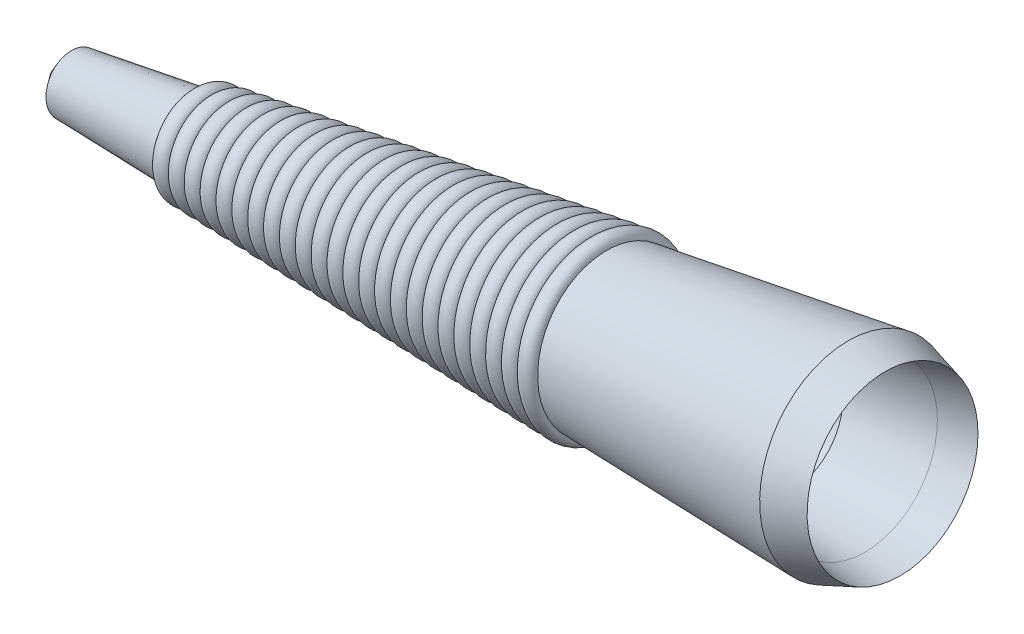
ISO-10303-21;
HEADER;
FILE_DESCRIPTION(('STEP AP214'),'2;1');
FILE_NAME('part.step','',(''),(''),'','','');
FILE_SCHEMA(('AUTOMOTIVE_DESIGN { 1 0 10303 214 1 1 1 1 }'));
ENDSEC;
DATA;
#1=APPLICATION_CONTEXT('core data for automotive mechanical design processes');
#2=APPLICATION_PROTOCOL_DEFINITION('international standard','automotive_design',2000,#1);
#3=PRODUCT_CONTEXT('',#1,'mechanical');
#4=PRODUCT('Part','Part','',(#3));
#5=PRODUCT_RELATED_PRODUCT_CATEGORY('part','',(#4));
#6=PRODUCT_DEFINITION_FORMATION('','',#4);
#7=PRODUCT_DEFINITION_CONTEXT('part definition',#1,'design');
#8=PRODUCT_DEFINITION('design','',#6,#7);
#9=PRODUCT_DEFINITION_SHAPE('','',#8);
#10=(LENGTH_UNIT() NAMED_UNIT(*) SI_UNIT(.MILLI.,.METRE.));
#11=(NAMED_UNIT(*) PLANE_ANGLE_UNIT() SI_UNIT($,.RADIAN.));
#12=(NAMED_UNIT(*) SI_UNIT($,.STERADIAN.) SOLID_ANGLE_UNIT());
#13=UNCERTAINTY_MEASURE_WITH_UNIT(LENGTH_MEASURE(1.E-05),#10,'distance_accuracy_value','');
#14=(GEOMETRIC_REPRESENTATION_CONTEXT(3) GLOBAL_UNCERTAINTY_ASSIGNED_CONTEXT((#13)) GLOBAL_UNIT_ASSIGNED_CONTEXT((#10,
#11,#12)) REPRESENTATION_CONTEXT('',''));
#15=CARTESIAN_POINT('',(0.,0.,0.));
#16=DIRECTION('',(0.,0.,1.));
#17=DIRECTION('',(1.,0.,0.));
#18=AXIS2_PLACEMENT_3D('',#15,#16,#17);
#19=CARTESIAN_POINT('',(96.5190442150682,11.6314501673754,0.));
#20=DIRECTION('',(0.996194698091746,0.0871557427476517,0.));
#21=DIRECTION('',(-0.0871557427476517,0.996194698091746,0.));
#22=AXIS2_PLACEMENT_3D('',#19,#20,#21);
#23=CONICAL_SURFACE('',#22,11.6758804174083,0.08726646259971);
#24=CARTESIAN_POINT('',(-0.276719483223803,3.1629181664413,0.));
#25=DIRECTION('',(-0.996194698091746,-0.0871557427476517,0.));
#26=DIRECTION('',(0.0871557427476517,-0.996194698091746,0.));
#27=AXIS2_PLACEMENT_3D('',#24,#25,#26);
#28=CIRCLE('',#27,3.17500000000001);
#29=CARTESIAN_POINT('',(-0.553438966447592,6.3258363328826,0.));
#30=VERTEX_POINT('',#29);
#31=EDGE_CURVE('E340',#30,#30,#28,.T.);
#32=CARTESIAN_POINT('',(96.5190442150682,11.6314501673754,0.));
#33=DIRECTION('',(-0.996194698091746,-0.0871557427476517,0.));
#34=DIRECTION('',(0.0871557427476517,-0.996194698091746,0.));
#35=AXIS2_PLACEMENT_3D('',#32,#33,#34);
#36=CIRCLE('',#35,11.6758804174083);
#37=CARTESIAN_POINT('',(95.5014241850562,23.2629003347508,0.));
#38=VERTEX_POINT('',#37);
#39=EDGE_CURVE('E10',#38,#38,#36,.T.);
#40=CARTESIAN_POINT('',(-0.553438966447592,6.3258363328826,0.));
#41=CARTESIAN_POINT('',(0.447132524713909,6.50226408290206,0.));
#42=CARTESIAN_POINT('',(1.44770401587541,6.67869183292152,0.));
#43=CARTESIAN_POINT('',(3.44884699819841,7.03154733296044,0.));
#44=CARTESIAN_POINT('',(4.44941848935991,7.2079750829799,0.));
#45=CARTESIAN_POINT('',(6.4505614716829,7.56083058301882,0.));
#46=CARTESIAN_POINT('',(7.4511329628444,7.73725833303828,0.));
#47=CARTESIAN_POINT('',(9.45227594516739,8.0901138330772,0.));
#48=CARTESIAN_POINT('',(10.4528474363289,8.26654158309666,0.));
#49=CARTESIAN_POINT('',(12.4539904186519,8.61939708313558,0.));
#50=CARTESIAN_POINT('',(13.4545619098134,8.79582483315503,0.));
#51=CARTESIAN_POINT('',(15.4557048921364,9.14868033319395,0.));
#52=CARTESIAN_POINT('',(16.4562763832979,9.32510808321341,0.));
#53=CARTESIAN_POINT('',(18.4574193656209,9.67796358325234,0.));
#54=CARTESIAN_POINT('',(19.4579908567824,9.8543913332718,0.));
#55=CARTESIAN_POINT('',(21.4591338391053,10.2072468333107,0.));
#56=CARTESIAN_POINT('',(22.4597053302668,10.3836745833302,0.));
#57=CARTESIAN_POINT('',(24.4608483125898,10.7365300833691,0.));
#58=CARTESIAN_POINT('',(25.4614198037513,10.9129578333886,0.));
#59=CARTESIAN_POINT('',(27.4625627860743,11.2658133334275,0.));
#60=CARTESIAN_POINT('',(28.4631342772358,11.4422410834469,0.));
#61=CARTESIAN_POINT('',(30.4642772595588,11.7950965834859,0.));
#62=CARTESIAN_POINT('',(31.4648487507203,11.9715243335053,0.));
#63=CARTESIAN_POINT('',(33.4659917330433,12.3243798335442,0.));
#64=CARTESIAN_POINT('',(34.4665632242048,12.5008075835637,0.));
#65=CARTESIAN_POINT('',(36.4677062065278,12.8536630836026,0.));
#66=CARTESIAN_POINT('',(37.4682776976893,13.0300908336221,0.));
#67=CARTESIAN_POINT('',(39.4694206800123,13.382946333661,0.));
#68=CARTESIAN_POINT('',(40.4699921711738,13.5593740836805,0.));
#69=CARTESIAN_POINT('',(42.4711351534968,13.9122295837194,0.));
#70=CARTESIAN_POINT('',(43.4717066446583,14.0886573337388,0.));
#71=CARTESIAN_POINT('',(45.4728496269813,14.4415128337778,0.));
#72=CARTESIAN_POINT('',(46.4734211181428,14.6179405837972,0.));
#73=CARTESIAN_POINT('',(48.4745641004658,14.9707960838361,0.));
#74=CARTESIAN_POINT('',(49.4751355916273,15.1472238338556,0.));
#75=CARTESIAN_POINT('',(51.4762785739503,15.5000793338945,0.));
#76=CARTESIAN_POINT('',(52.4768500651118,15.676507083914,0.));
#77=CARTESIAN_POINT('',(54.4779930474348,16.0293625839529,0.));
#78=CARTESIAN_POINT('',(55.4785645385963,16.2057903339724,0.));
#79=CARTESIAN_POINT('',(57.4797075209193,16.5586458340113,0.));
#80=CARTESIAN_POINT('',(58.4802790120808,16.7350735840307,0.));
#81=CARTESIAN_POINT('',(60.4814219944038,17.0879290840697,0.));
#82=CARTESIAN_POINT('',(61.4819934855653,17.2643568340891,0.));
#83=CARTESIAN_POINT('',(63.4831364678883,17.617212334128,0.));
#84=CARTESIAN_POINT('',(64.4837079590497,17.7936400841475,0.));
#85=CARTESIAN_POINT('',(66.4848509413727,18.1464955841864,0.));
#86=CARTESIAN_POINT('',(67.4854224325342,18.3229233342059,0.));
#87=CARTESIAN_POINT('',(69.4865654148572,18.6757788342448,0.));
#88=CARTESIAN_POINT('',(70.4871369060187,18.8522065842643,0.));
#89=CARTESIAN_POINT('',(72.4882798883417,19.2050620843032,0.));
#90=CARTESIAN_POINT('',(73.4888513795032,19.3814898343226,0.));
#91=CARTESIAN_POINT('',(75.4899943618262,19.7343453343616,0.));
#92=CARTESIAN_POINT('',(76.4905658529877,19.910773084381,0.));
#93=CARTESIAN_POINT('',(78.4917088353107,20.2636285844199,0.));
#94=CARTESIAN_POINT('',(79.4922803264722,20.4400563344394,0.));
#95=CARTESIAN_POINT('',(81.4934233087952,20.7929118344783,0.));
#96=CARTESIAN_POINT('',(82.4939947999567,20.9693395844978,0.));
#97=CARTESIAN_POINT('',(84.4951377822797,21.3221950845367,0.));
#98=CARTESIAN_POINT('',(85.4957092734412,21.4986228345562,0.));
#99=CARTESIAN_POINT('',(87.4968522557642,21.8514783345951,0.));
#100=CARTESIAN_POINT('',(88.4974237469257,22.0279060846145,0.));
#101=CARTESIAN_POINT('',(90.4985667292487,22.3807615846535,0.));
#102=CARTESIAN_POINT('',(91.4991382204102,22.5571893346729,0.));
#103=CARTESIAN_POINT('',(93.5002812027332,22.9100448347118,0.));
#104=CARTESIAN_POINT('',(94.5008526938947,23.0864725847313,0.));
#105=CARTESIAN_POINT('',(95.5014241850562,23.2629003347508,0.));
#106=B_SPLINE_CURVE_WITH_KNOTS('',3,(#40,#41,#42,#43,#44,#45,#46,#47,#48,#49,#50,#51,#52,#53,
#54,#55,#56,#57,#58,#59,#60,#61,#62,#63,#64,#65,#66,#67,#68,#69,#70,#71,#72,#73,#74,#75,#76,#77,
#78,#79,#80,#81,#82,#83,#84,#85,#86,#87,#88,#89,#90,#91,#92,#93,#94,#95,#96,#97,#98,#99,#100,
#101,#102,#103,#104,#105),.UNSPECIFIED.,.F.,.F.,(4,2,2,2,2,2,2,2,2,2,2,2,2,2,2,2,2,2,2,2,2,2,2,
2,2,2,2,2,2,2,2,2,4),(0.,3.04802075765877,6.09604151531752,9.14406227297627,12.192083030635,
15.2401037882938,18.2881245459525,21.3361453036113,24.38416606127,27.4321868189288,
30.4802075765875,33.5282283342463,36.576249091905,39.6242698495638,42.6722906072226,
45.7203113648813,48.7683321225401,51.8163528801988,54.8643736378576,57.9123943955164,
60.9604151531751,64.0084359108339,67.0564566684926,70.1044774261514,73.1524981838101,
76.2005189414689,79.2485396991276,82.2965604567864,85.3445812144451,88.3926019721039,
91.4406227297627,94.4886434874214,97.5366642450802),.UNSPECIFIED.);
#107=EDGE_CURVE('BSEAM41',#30,#38,#106,.T.);
#108=ORIENTED_EDGE('',*,*,#31,.T.);
#109=ORIENTED_EDGE('',*,*,#39,.F.);
#110=ORIENTED_EDGE('',*,*,#107,.T.);
#111=ORIENTED_EDGE('',*,*,#107,.F.);
#112=EDGE_LOOP('',(#108,#110,#109,#111));
#113=FACE_BOUND('',#112,.T.);
#114=ADVANCED_FACE('F41',(#113),#23,.F.);
#115=CARTESIAN_POINT('',(103.372141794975,12.2310185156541,0.));
#116=DIRECTION('',(-0.996194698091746,-0.0871557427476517,0.));
#117=DIRECTION('',(0.0871557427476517,-0.996194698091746,0.));
#118=AXIS2_PLACEMENT_3D('',#115,#116,#117);
#119=CONICAL_SURFACE('',#118,5.9034830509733,0.69813170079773);
#120=ORIENTED_EDGE('',*,*,#39,.T.);
#121=EDGE_LOOP('',(#120));
#122=FACE_BOUND('',#121,.T.);
#123=CARTESIAN_POINT('',(103.372141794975,12.2310185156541,0.));
#124=DIRECTION('',(-0.996194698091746,-0.0871557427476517,0.));
#125=DIRECTION('',(0.0871557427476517,-0.996194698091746,0.));
#126=AXIS2_PLACEMENT_3D('',#123,#124,#125);
#127=CIRCLE('',#126,5.9034830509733);
#128=CARTESIAN_POINT('',(103.88666424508,6.35,0.));
#129=VERTEX_POINT('',#128);
#130=EDGE_CURVE('E48',#129,#129,#127,.T.);
#131=ORIENTED_EDGE('',*,*,#130,.F.);
#132=EDGE_LOOP('',(#131));
#133=FACE_BOUND('',#132,.T.);
#134=ADVANCED_FACE('F359',(#122,#133),#119,.F.);
#135=CARTESIAN_POINT('',(106.523024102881,12.5066849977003,0.));
#136=DIRECTION('',(0.996194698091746,0.0871557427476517,0.));
#137=DIRECTION('',(-0.0871557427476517,0.996194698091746,0.));
#138=AXIS2_PLACEMENT_3D('',#135,#136,#137);
#139=CONICAL_SURFACE('',#138,6.18020253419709,0.08726646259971);
#140=ORIENTED_EDGE('',*,*,#130,.T.);
#141=EDGE_LOOP('',(#140));
#142=FACE_BOUND('',#141,.T.);
#143=CARTESIAN_POINT('',(106.523024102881,12.5066849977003,0.));
#144=DIRECTION('',(-0.996194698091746,-0.0871557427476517,0.));
#145=DIRECTION('',(0.0871557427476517,-0.996194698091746,0.));
#146=AXIS2_PLACEMENT_3D('',#143,#144,#145);
#147=CIRCLE('',#146,6.18020253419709);
#148=CARTESIAN_POINT('',(107.06166424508,6.35,0.));
#149=VERTEX_POINT('',#148);
#150=EDGE_CURVE('E53',#149,#149,#147,.T.);
#151=ORIENTED_EDGE('',*,*,#150,.F.);
#152=EDGE_LOOP('',(#151));
#153=FACE_BOUND('',#152,.T.);
#154=ADVANCED_FACE('F363',(#142,#153),#139,.F.);
#155=CARTESIAN_POINT('',(99.6699265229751,11.9071166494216,0.));
#156=DIRECTION('',(-0.996194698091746,-0.0871557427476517,0.));
#157=DIRECTION('',(0.0871557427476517,-0.996194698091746,0.));
#158=AXIS2_PLACEMENT_3D('',#155,#156,#157);
#159=CONICAL_SURFACE('',#158,11.9525999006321,0.698131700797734);
#160=ORIENTED_EDGE('',*,*,#150,.T.);
#161=EDGE_LOOP('',(#160));
#162=FACE_BOUND('',#161,.T.);
#163=CARTESIAN_POINT('',(99.6699265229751,11.9071166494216,0.));
#164=DIRECTION('',(-0.996194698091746,-0.0871557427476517,0.));
#165=DIRECTION('',(0.0871557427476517,-0.996194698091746,0.));
#166=AXIS2_PLACEMENT_3D('',#163,#164,#165);
#167=CIRCLE('',#166,11.9525999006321);
#168=CARTESIAN_POINT('',(100.71166424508,0.,0.));
#169=VERTEX_POINT('',#168);
#170=EDGE_CURVE('E58',#169,#169,#167,.T.);
#171=ORIENTED_EDGE('',*,*,#170,.F.);
#172=EDGE_LOOP('',(#171));
#173=FACE_BOUND('',#172,.T.);
#174=ADVANCED_FACE('F367',(#162,#173),#159,.T.);
#175=CARTESIAN_POINT('',(112.273455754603,13.0097825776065,0.));
#176=DIRECTION('',(0.996194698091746,0.0871557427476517,0.));
#177=DIRECTION('',(-0.0871557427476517,0.996194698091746,0.));
#178=AXIS2_PLACEMENT_3D('',#175,#176,#177);
#179=CONICAL_SURFACE('',#178,13.0594778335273,0.0872664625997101);
#180=ORIENTED_EDGE('',*,*,#170,.T.);
#181=EDGE_LOOP('',(#180));
#182=FACE_BOUND('',#181,.T.);
#183=CARTESIAN_POINT('',(112.273455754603,13.0097825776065,0.));
#184=DIRECTION('',(-0.996194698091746,-0.0871557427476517,0.));
#185=DIRECTION('',(0.0871557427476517,-0.996194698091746,0.));
#186=AXIS2_PLACEMENT_3D('',#183,#184,#185);
#187=CIRCLE('',#186,13.0594778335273);
#188=CARTESIAN_POINT('',(113.41166424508,0.,0.));
#189=VERTEX_POINT('',#188);
#190=EDGE_CURVE('E64',#189,#189,#187,.T.);
#191=ORIENTED_EDGE('',*,*,#190,.F.);
#192=EDGE_LOOP('',(#191));
#193=FACE_BOUND('',#192,.T.);
#194=ADVANCED_FACE('F373',(#182,#193),#179,.F.);
#195=CARTESIAN_POINT('',(119.126553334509,13.6093509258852,0.));
#196=DIRECTION('',(-0.996194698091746,-0.0871557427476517,0.));
#197=DIRECTION('',(0.0871557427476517,-0.996194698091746,0.));
#198=AXIS2_PLACEMENT_3D('',#195,#196,#197);
#199=CONICAL_SURFACE('',#198,7.28708046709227,0.698131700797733);
#200=ORIENTED_EDGE('',*,*,#190,.T.);
#201=EDGE_LOOP('',(#200));
#202=FACE_BOUND('',#201,.T.);
#203=CARTESIAN_POINT('',(119.126553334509,13.6093509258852,0.));
#204=DIRECTION('',(-0.996194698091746,-0.0871557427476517,0.));
#205=DIRECTION('',(0.0871557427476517,-0.996194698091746,0.));
#206=AXIS2_PLACEMENT_3D('',#203,#204,#205);
#207=CIRCLE('',#206,7.28708046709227);
#208=CARTESIAN_POINT('',(119.76166424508,6.35,0.));
#209=VERTEX_POINT('',#208);
#210=EDGE_CURVE('E68',#209,#209,#207,.T.);
#211=ORIENTED_EDGE('',*,*,#210,.F.);
#212=EDGE_LOOP('',(#211));
#213=FACE_BOUND('',#212,.T.);
#214=ADVANCED_FACE('F377',(#202,#213),#199,.F.);
#215=CARTESIAN_POINT('',(122.277435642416,13.8850174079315,0.));
#216=DIRECTION('',(0.996194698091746,0.0871557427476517,0.));
#217=DIRECTION('',(-0.0871557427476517,0.996194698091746,0.));
#218=AXIS2_PLACEMENT_3D('',#215,#216,#217);
#219=CONICAL_SURFACE('',#218,7.56379995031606,0.0872664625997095);
#220=ORIENTED_EDGE('',*,*,#210,.T.);
#221=EDGE_LOOP('',(#220));
#222=FACE_BOUND('',#221,.T.);
#223=CARTESIAN_POINT('',(122.277435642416,13.8850174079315,0.));
#224=DIRECTION('',(-0.996194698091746,-0.0871557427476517,0.));
#225=DIRECTION('',(0.0871557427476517,-0.996194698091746,0.));
#226=AXIS2_PLACEMENT_3D('',#223,#224,#225);
#227=CIRCLE('',#226,7.56379995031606);
#228=CARTESIAN_POINT('',(122.93666424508,6.35,0.));
#229=VERTEX_POINT('',#228);
#230=EDGE_CURVE('E72',#229,#229,#227,.T.);
#231=ORIENTED_EDGE('',*,*,#230,.F.);
#232=EDGE_LOOP('',(#231));
#233=FACE_BOUND('',#232,.T.);
#234=ADVANCED_FACE('F381',(#222,#233),#219,.F.);
#235=CARTESIAN_POINT('',(115.424338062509,13.2854490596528,0.));
#236=DIRECTION('',(-0.996194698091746,-0.0871557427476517,0.));
#237=DIRECTION('',(0.0871557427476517,-0.996194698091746,0.));
#238=AXIS2_PLACEMENT_3D('',#235,#236,#237);
#239=CONICAL_SURFACE('',#238,13.3361973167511,0.698131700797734);
#240=ORIENTED_EDGE('',*,*,#230,.T.);
#241=EDGE_LOOP('',(#240));
#242=FACE_BOUND('',#241,.T.);
#243=CARTESIAN_POINT('',(115.424338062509,13.2854490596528,0.));
#244=DIRECTION('',(-0.996194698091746,-0.0871557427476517,0.));
#245=DIRECTION('',(0.0871557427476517,-0.996194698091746,0.));
#246=AXIS2_PLACEMENT_3D('',#243,#244,#245);
#247=CIRCLE('',#246,13.3361973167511);
#248=CARTESIAN_POINT('',(116.58666424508,0.,0.));
#249=VERTEX_POINT('',#248);
#250=EDGE_CURVE('E76',#249,#249,#247,.T.);
#251=ORIENTED_EDGE('',*,*,#250,.F.);
#252=EDGE_LOOP('',(#251));
#253=FACE_BOUND('',#252,.T.);
#254=ADVANCED_FACE('F385',(#242,#253),#239,.T.);
#255=CARTESIAN_POINT('',(128.027867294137,14.3881149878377,0.));
#256=DIRECTION('',(0.996194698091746,0.0871557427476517,0.));
#257=DIRECTION('',(-0.0871557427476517,0.996194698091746,0.));
#258=AXIS2_PLACEMENT_3D('',#255,#256,#257);
#259=CONICAL_SURFACE('',#258,14.4430752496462,0.0872664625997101);
#260=ORIENTED_EDGE('',*,*,#250,.T.);
#261=EDGE_LOOP('',(#260));
#262=FACE_BOUND('',#261,.T.);
#263=CARTESIAN_POINT('',(128.027867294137,14.3881149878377,0.));
#264=DIRECTION('',(-0.996194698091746,-0.0871557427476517,0.));
#265=DIRECTION('',(0.0871557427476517,-0.996194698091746,0.));
#266=AXIS2_PLACEMENT_3D('',#263,#264,#265);
#267=CIRCLE('',#266,14.4430752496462);
#268=CARTESIAN_POINT('',(129.28666424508,0.,0.));
#269=VERTEX_POINT('',#268);
#270=EDGE_CURVE('E80',#269,#269,#267,.T.);
#271=ORIENTED_EDGE('',*,*,#270,.F.);
#272=EDGE_LOOP('',(#271));
#273=FACE_BOUND('',#272,.T.);
#274=ADVANCED_FACE('F389',(#262,#273),#259,.F.);
#275=CARTESIAN_POINT('',(134.880964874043,14.9876833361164,0.));
#276=DIRECTION('',(-0.996194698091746,-0.0871557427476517,0.));
#277=DIRECTION('',(0.0871557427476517,-0.996194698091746,0.));
#278=AXIS2_PLACEMENT_3D('',#275,#276,#277);
#279=CONICAL_SURFACE('',#278,8.67067788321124,0.698131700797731);
#280=ORIENTED_EDGE('',*,*,#270,.T.);
#281=EDGE_LOOP('',(#280));
#282=FACE_BOUND('',#281,.T.);
#283=CARTESIAN_POINT('',(134.880964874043,14.9876833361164,0.));
#284=DIRECTION('',(-0.996194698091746,-0.0871557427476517,0.));
#285=DIRECTION('',(0.0871557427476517,-0.996194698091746,0.));
#286=AXIS2_PLACEMENT_3D('',#283,#284,#285);
#287=CIRCLE('',#286,8.67067788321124);
#288=CARTESIAN_POINT('',(135.63666424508,6.35,0.));
#289=VERTEX_POINT('',#288);
#290=EDGE_CURVE('E84',#289,#289,#287,.T.);
#291=ORIENTED_EDGE('',*,*,#290,.F.);
#292=EDGE_LOOP('',(#291));
#293=FACE_BOUND('',#292,.T.);
#294=ADVANCED_FACE('F393',(#282,#293),#279,.F.);
#295=CARTESIAN_POINT('',(138.03184718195,15.2633498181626,0.));
#296=DIRECTION('',(0.996194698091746,0.0871557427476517,0.));
#297=DIRECTION('',(-0.0871557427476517,0.996194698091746,0.));
#298=AXIS2_PLACEMENT_3D('',#295,#296,#297);
#299=CONICAL_SURFACE('',#298,8.94739736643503,0.0872664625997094);
#300=ORIENTED_EDGE('',*,*,#290,.T.);
#301=EDGE_LOOP('',(#300));
#302=FACE_BOUND('',#301,.T.);
#303=CARTESIAN_POINT('',(138.03184718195,15.2633498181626,0.));
#304=DIRECTION('',(-0.996194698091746,-0.0871557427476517,0.));
#305=DIRECTION('',(0.0871557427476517,-0.996194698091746,0.));
#306=AXIS2_PLACEMENT_3D('',#303,#304,#305);
#307=CIRCLE('',#306,8.94739736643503);
#308=CARTESIAN_POINT('',(138.81166424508,6.35,0.));
#309=VERTEX_POINT('',#308);
#310=EDGE_CURVE('E88',#309,#309,#307,.T.);
#311=ORIENTED_EDGE('',*,*,#310,.F.);
#312=EDGE_LOOP('',(#311));
#313=FACE_BOUND('',#312,.T.);
#314=ADVANCED_FACE('F397',(#302,#313),#299,.F.);
#315=CARTESIAN_POINT('',(131.178749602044,14.6637814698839,0.));
#316=DIRECTION('',(-0.996194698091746,-0.0871557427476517,0.));
#317=DIRECTION('',(0.0871557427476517,-0.996194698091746,0.));
#318=AXIS2_PLACEMENT_3D('',#315,#316,#317);
#319=CONICAL_SURFACE('',#318,14.71979473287,0.698131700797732);
#320=ORIENTED_EDGE('',*,*,#310,.T.);
#321=EDGE_LOOP('',(#320));
#322=FACE_BOUND('',#321,.T.);
#323=CARTESIAN_POINT('',(131.178749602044,14.6637814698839,0.));
#324=DIRECTION('',(-0.996194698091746,-0.0871557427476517,0.));
#325=DIRECTION('',(0.0871557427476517,-0.996194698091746,0.));
#326=AXIS2_PLACEMENT_3D('',#323,#324,#325);
#327=CIRCLE('',#326,14.71979473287);
#328=CARTESIAN_POINT('',(132.46166424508,0.,0.));
#329=VERTEX_POINT('',#328);
#330=EDGE_CURVE('E92',#329,#329,#327,.T.);
#331=ORIENTED_EDGE('',*,*,#330,.F.);
#332=EDGE_LOOP('',(#331));
#333=FACE_BOUND('',#332,.T.);
#334=ADVANCED_FACE('F401',(#322,#333),#319,.T.);
#335=CARTESIAN_POINT('',(143.782278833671,15.7664473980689,0.));
#336=DIRECTION('',(0.996194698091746,0.0871557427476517,0.));
#337=DIRECTION('',(-0.0871557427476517,0.996194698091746,0.));
#338=AXIS2_PLACEMENT_3D('',#335,#336,#337);
#339=CONICAL_SURFACE('',#338,15.8266726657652,0.0872664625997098);
#340=ORIENTED_EDGE('',*,*,#330,.T.);
#341=EDGE_LOOP('',(#340));
#342=FACE_BOUND('',#341,.T.);
#343=CARTESIAN_POINT('',(143.782278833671,15.7664473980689,0.));
#344=DIRECTION('',(-0.996194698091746,-0.0871557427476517,0.));
#345=DIRECTION('',(0.0871557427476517,-0.996194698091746,0.));
#346=AXIS2_PLACEMENT_3D('',#343,#344,#345);
#347=CIRCLE('',#346,15.8266726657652);
#348=CARTESIAN_POINT('',(145.16166424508,0.,0.));
#349=VERTEX_POINT('',#348);
#350=EDGE_CURVE('E96',#349,#349,#347,.T.);
#351=ORIENTED_EDGE('',*,*,#350,.F.);
#352=EDGE_LOOP('',(#351));
#353=FACE_BOUND('',#352,.T.);
#354=ADVANCED_FACE('F405',(#342,#353),#339,.F.);
#355=CARTESIAN_POINT('',(150.635376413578,16.3660157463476,0.));
#356=DIRECTION('',(-0.996194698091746,-0.0871557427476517,0.));
#357=DIRECTION('',(0.0871557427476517,-0.996194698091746,0.));
#358=AXIS2_PLACEMENT_3D('',#355,#356,#357);
#359=CONICAL_SURFACE('',#358,10.0542752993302,0.698131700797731);
#360=ORIENTED_EDGE('',*,*,#350,.T.);
#361=EDGE_LOOP('',(#360));
#362=FACE_BOUND('',#361,.T.);
#363=CARTESIAN_POINT('',(150.635376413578,16.3660157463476,0.));
#364=DIRECTION('',(-0.996194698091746,-0.0871557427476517,0.));
#365=DIRECTION('',(0.0871557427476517,-0.996194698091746,0.));
#366=AXIS2_PLACEMENT_3D('',#363,#364,#365);
#367=CIRCLE('',#366,10.0542752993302);
#368=CARTESIAN_POINT('',(151.51166424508,6.35,0.));
#369=VERTEX_POINT('',#368);
#370=EDGE_CURVE('E100',#369,#369,#367,.T.);
#371=ORIENTED_EDGE('',*,*,#370,.F.);
#372=EDGE_LOOP('',(#371));
#373=FACE_BOUND('',#372,.T.);
#374=ADVANCED_FACE('F409',(#362,#373),#359,.F.);
#375=CARTESIAN_POINT('',(153.786258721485,16.6416822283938,0.));
#376=DIRECTION('',(0.996194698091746,0.0871557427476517,0.));
#377=DIRECTION('',(-0.0871557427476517,0.996194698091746,0.));
#378=AXIS2_PLACEMENT_3D('',#375,#376,#377);
#379=CONICAL_SURFACE('',#378,10.330994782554,0.0872664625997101);
#380=ORIENTED_EDGE('',*,*,#370,.T.);
#381=EDGE_LOOP('',(#380));
#382=FACE_BOUND('',#381,.T.);
#383=CARTESIAN_POINT('',(153.786258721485,16.6416822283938,0.));
#384=DIRECTION('',(-0.996194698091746,-0.0871557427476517,0.));
#385=DIRECTION('',(0.0871557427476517,-0.996194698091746,0.));
#386=AXIS2_PLACEMENT_3D('',#383,#384,#385);
#387=CIRCLE('',#386,10.330994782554);
#388=CARTESIAN_POINT('',(154.68666424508,6.35,0.));
#389=VERTEX_POINT('',#388);
#390=EDGE_CURVE('E104',#389,#389,#387,.T.);
#391=ORIENTED_EDGE('',*,*,#390,.F.);
#392=EDGE_LOOP('',(#391));
#393=FACE_BOUND('',#392,.T.);
#394=ADVANCED_FACE('F413',(#382,#393),#379,.F.);
#395=CARTESIAN_POINT('',(146.933161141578,16.0421138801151,0.));
#396=DIRECTION('',(-0.996194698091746,-0.0871557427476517,0.));
#397=DIRECTION('',(0.0871557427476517,-0.996194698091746,0.));
#398=AXIS2_PLACEMENT_3D('',#395,#396,#397);
#399=CONICAL_SURFACE('',#398,16.103392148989,0.698131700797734);
#400=ORIENTED_EDGE('',*,*,#390,.T.);
#401=EDGE_LOOP('',(#400));
#402=FACE_BOUND('',#401,.T.);
#403=CARTESIAN_POINT('',(146.933161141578,16.0421138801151,0.));
#404=DIRECTION('',(-0.996194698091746,-0.0871557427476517,0.));
#405=DIRECTION('',(0.0871557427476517,-0.996194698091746,0.));
#406=AXIS2_PLACEMENT_3D('',#403,#404,#405);
#407=CIRCLE('',#406,16.103392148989);
#408=CARTESIAN_POINT('',(148.33666424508,0.,0.));
#409=VERTEX_POINT('',#408);
#410=EDGE_CURVE('E108',#409,#409,#407,.T.);
#411=ORIENTED_EDGE('',*,*,#410,.F.);
#412=EDGE_LOOP('',(#411));
#413=FACE_BOUND('',#412,.T.);
#414=ADVANCED_FACE('F417',(#402,#413),#399,.T.);
#415=CARTESIAN_POINT('',(159.536690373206,17.1447798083,0.));
#416=DIRECTION('',(0.996194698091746,0.0871557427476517,0.));
#417=DIRECTION('',(-0.0871557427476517,0.996194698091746,0.));
#418=AXIS2_PLACEMENT_3D('',#415,#416,#417);
#419=CONICAL_SURFACE('',#418,17.2102700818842,0.0872664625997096);
#420=ORIENTED_EDGE('',*,*,#410,.T.);
#421=EDGE_LOOP('',(#420));
#422=FACE_BOUND('',#421,.T.);
#423=CARTESIAN_POINT('',(159.536690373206,17.1447798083,0.));
#424=DIRECTION('',(-0.996194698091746,-0.0871557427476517,0.));
#425=DIRECTION('',(0.0871557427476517,-0.996194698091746,0.));
#426=AXIS2_PLACEMENT_3D('',#423,#424,#425);
#427=CIRCLE('',#426,17.2102700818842);
#428=CARTESIAN_POINT('',(161.03666424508,0.,0.));
#429=VERTEX_POINT('',#428);
#430=EDGE_CURVE('E112',#429,#429,#427,.T.);
#431=ORIENTED_EDGE('',*,*,#430,.F.);
#432=EDGE_LOOP('',(#431));
#433=FACE_BOUND('',#432,.T.);
#434=ADVANCED_FACE('F421',(#422,#433),#419,.F.);
#435=CARTESIAN_POINT('',(166.389787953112,17.7443481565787,0.));
#436=DIRECTION('',(-0.996194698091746,-0.0871557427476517,0.));
#437=DIRECTION('',(0.0871557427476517,-0.996194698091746,0.));
#438=AXIS2_PLACEMENT_3D('',#435,#436,#437);
#439=CONICAL_SURFACE('',#438,11.4378727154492,0.698131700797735);
#440=ORIENTED_EDGE('',*,*,#430,.T.);
#441=EDGE_LOOP('',(#440));
#442=FACE_BOUND('',#441,.T.);
#443=CARTESIAN_POINT('',(166.389787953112,17.7443481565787,0.));
#444=DIRECTION('',(-0.996194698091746,-0.0871557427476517,0.));
#445=DIRECTION('',(0.0871557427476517,-0.996194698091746,0.));
#446=AXIS2_PLACEMENT_3D('',#443,#444,#445);
#447=CIRCLE('',#446,11.4378727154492);
#448=CARTESIAN_POINT('',(167.38666424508,6.35,0.));
#449=VERTEX_POINT('',#448);
#450=EDGE_CURVE('E116',#449,#449,#447,.T.);
#451=ORIENTED_EDGE('',*,*,#450,.F.);
#452=EDGE_LOOP('',(#451));
#453=FACE_BOUND('',#452,.T.);
#454=ADVANCED_FACE('F425',(#442,#453),#439,.F.);
#455=CARTESIAN_POINT('',(169.540670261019,18.0200146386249,0.));
#456=DIRECTION('',(0.996194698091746,0.0871557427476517,0.));
#457=DIRECTION('',(-0.0871557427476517,0.996194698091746,0.));
#458=AXIS2_PLACEMENT_3D('',#455,#456,#457);
#459=CONICAL_SURFACE('',#458,11.714592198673,0.0872664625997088);
#460=ORIENTED_EDGE('',*,*,#450,.T.);
#461=EDGE_LOOP('',(#460));
#462=FACE_BOUND('',#461,.T.);
#463=CARTESIAN_POINT('',(169.540670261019,18.0200146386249,0.));
#464=DIRECTION('',(-0.996194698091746,-0.0871557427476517,0.));
#465=DIRECTION('',(0.0871557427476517,-0.996194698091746,0.));
#466=AXIS2_PLACEMENT_3D('',#463,#464,#465);
#467=CIRCLE('',#466,11.714592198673);
#468=CARTESIAN_POINT('',(170.56166424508,6.35,0.));
#469=VERTEX_POINT('',#468);
#470=EDGE_CURVE('E120',#469,#469,#467,.T.);
#471=ORIENTED_EDGE('',*,*,#470,.F.);
#472=EDGE_LOOP('',(#471));
#473=FACE_BOUND('',#472,.T.);
#474=ADVANCED_FACE('F429',(#462,#473),#459,.F.);
#475=CARTESIAN_POINT('',(162.687572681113,17.4204462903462,0.));
#476=DIRECTION('',(-0.996194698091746,-0.0871557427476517,0.));
#477=DIRECTION('',(0.0871557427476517,-0.996194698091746,0.));
#478=AXIS2_PLACEMENT_3D('',#475,#476,#477);
#479=CONICAL_SURFACE('',#478,17.486989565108,0.698131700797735);
#480=ORIENTED_EDGE('',*,*,#470,.T.);
#481=EDGE_LOOP('',(#480));
#482=FACE_BOUND('',#481,.T.);
#483=CARTESIAN_POINT('',(162.687572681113,17.4204462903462,0.));
#484=DIRECTION('',(-0.996194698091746,-0.0871557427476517,0.));
#485=DIRECTION('',(0.0871557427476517,-0.996194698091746,0.));
#486=AXIS2_PLACEMENT_3D('',#483,#484,#485);
#487=CIRCLE('',#486,17.486989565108);
#488=CARTESIAN_POINT('',(164.21166424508,0.,0.));
#489=VERTEX_POINT('',#488);
#490=EDGE_CURVE('E124',#489,#489,#487,.T.);
#491=ORIENTED_EDGE('',*,*,#490,.F.);
#492=EDGE_LOOP('',(#491));
#493=FACE_BOUND('',#492,.T.);
#494=ADVANCED_FACE('F433',(#482,#493),#479,.T.);
#495=CARTESIAN_POINT('',(175.29110191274,18.5231122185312,0.));
#496=DIRECTION('',(0.996194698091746,0.0871557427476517,0.));
#497=DIRECTION('',(-0.0871557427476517,0.996194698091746,0.));
#498=AXIS2_PLACEMENT_3D('',#495,#496,#497);
#499=CONICAL_SURFACE('',#498,18.5938674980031,0.0872664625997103);
#500=ORIENTED_EDGE('',*,*,#490,.T.);
#501=EDGE_LOOP('',(#500));
#502=FACE_BOUND('',#501,.T.);
#503=CARTESIAN_POINT('',(175.29110191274,18.5231122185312,0.));
#504=DIRECTION('',(-0.996194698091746,-0.0871557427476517,0.));
#505=DIRECTION('',(0.0871557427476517,-0.996194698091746,0.));
#506=AXIS2_PLACEMENT_3D('',#503,#504,#505);
#507=CIRCLE('',#506,18.5938674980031);
#508=CARTESIAN_POINT('',(176.91166424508,0.,0.));
#509=VERTEX_POINT('',#508);
#510=EDGE_CURVE('E128',#509,#509,#507,.T.);
#511=ORIENTED_EDGE('',*,*,#510,.F.);
#512=EDGE_LOOP('',(#511));
#513=FACE_BOUND('',#512,.T.);
#514=ADVANCED_FACE('F437',(#502,#513),#499,.F.);
#515=CARTESIAN_POINT('',(182.144199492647,19.1226805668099,0.));
#516=DIRECTION('',(-0.996194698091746,-0.0871557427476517,0.));
#517=DIRECTION('',(0.0871557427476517,-0.996194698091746,0.));
#518=AXIS2_PLACEMENT_3D('',#515,#516,#517);
#519=CONICAL_SURFACE('',#518,12.8214701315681,0.698131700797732);
#520=ORIENTED_EDGE('',*,*,#510,.T.);
#521=EDGE_LOOP('',(#520));
#522=FACE_BOUND('',#521,.T.);
#523=CARTESIAN_POINT('',(182.144199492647,19.1226805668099,0.));
#524=DIRECTION('',(-0.996194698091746,-0.0871557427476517,0.));
#525=DIRECTION('',(0.0871557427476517,-0.996194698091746,0.));
#526=AXIS2_PLACEMENT_3D('',#523,#524,#525);
#527=CIRCLE('',#526,12.8214701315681);
#528=CARTESIAN_POINT('',(183.26166424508,6.35,0.));
#529=VERTEX_POINT('',#528);
#530=EDGE_CURVE('E132',#529,#529,#527,.T.);
#531=ORIENTED_EDGE('',*,*,#530,.F.);
#532=EDGE_LOOP('',(#531));
#533=FACE_BOUND('',#532,.T.);
#534=ADVANCED_FACE('F441',(#522,#533),#519,.F.);
#535=CARTESIAN_POINT('',(185.295081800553,19.3983470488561,0.));
#536=DIRECTION('',(0.996194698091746,0.0871557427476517,0.));
#537=DIRECTION('',(-0.0871557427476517,0.996194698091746,0.));
#538=AXIS2_PLACEMENT_3D('',#535,#536,#537);
#539=CONICAL_SURFACE('',#538,13.0981896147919,0.0872664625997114);
#540=ORIENTED_EDGE('',*,*,#530,.T.);
#541=EDGE_LOOP('',(#540));
#542=FACE_BOUND('',#541,.T.);
#543=CARTESIAN_POINT('',(185.295081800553,19.3983470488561,0.));
#544=DIRECTION('',(-0.996194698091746,-0.0871557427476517,0.));
#545=DIRECTION('',(0.0871557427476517,-0.996194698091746,0.));
#546=AXIS2_PLACEMENT_3D('',#543,#544,#545);
#547=CIRCLE('',#546,13.0981896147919);
#548=CARTESIAN_POINT('',(186.43666424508,6.35,0.));
#549=VERTEX_POINT('',#548);
#550=EDGE_CURVE('E136',#549,#549,#547,.T.);
#551=ORIENTED_EDGE('',*,*,#550,.F.);
#552=EDGE_LOOP('',(#551));
#553=FACE_BOUND('',#552,.T.);
#554=ADVANCED_FACE('F445',(#542,#553),#539,.F.);
#555=CARTESIAN_POINT('',(178.441984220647,18.7987787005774,0.));
#556=DIRECTION('',(-0.996194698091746,-0.0871557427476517,0.));
#557=DIRECTION('',(0.0871557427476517,-0.996194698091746,0.));
#558=AXIS2_PLACEMENT_3D('',#555,#556,#557);
#559=CONICAL_SURFACE('',#558,18.8705869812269,0.698131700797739);
#560=ORIENTED_EDGE('',*,*,#550,.T.);
#561=EDGE_LOOP('',(#560));
#562=FACE_BOUND('',#561,.T.);
#563=CARTESIAN_POINT('',(178.441984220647,18.7987787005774,0.));
#564=DIRECTION('',(-0.996194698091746,-0.0871557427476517,0.));
#565=DIRECTION('',(0.0871557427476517,-0.996194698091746,0.));
#566=AXIS2_PLACEMENT_3D('',#563,#564,#565);
#567=CIRCLE('',#566,18.8705869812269);
#568=CARTESIAN_POINT('',(180.08666424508,0.,0.));
#569=VERTEX_POINT('',#568);
#570=EDGE_CURVE('E140',#569,#569,#567,.T.);
#571=ORIENTED_EDGE('',*,*,#570,.F.);
#572=EDGE_LOOP('',(#571));
#573=FACE_BOUND('',#572,.T.);
#574=ADVANCED_FACE('F449',(#562,#573),#559,.T.);
#575=CARTESIAN_POINT('',(191.045513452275,19.9014446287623,0.));
#576=DIRECTION('',(0.996194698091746,0.0871557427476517,0.));
#577=DIRECTION('',(-0.0871557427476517,0.996194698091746,0.));
#578=AXIS2_PLACEMENT_3D('',#575,#576,#577);
#579=CONICAL_SURFACE('',#578,19.9774649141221,0.0872664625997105);
#580=ORIENTED_EDGE('',*,*,#570,.T.);
#581=EDGE_LOOP('',(#580));
#582=FACE_BOUND('',#581,.T.);
#583=CARTESIAN_POINT('',(191.045513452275,19.9014446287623,0.));
#584=DIRECTION('',(-0.996194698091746,-0.0871557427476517,0.));
#585=DIRECTION('',(0.0871557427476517,-0.996194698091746,0.));
#586=AXIS2_PLACEMENT_3D('',#583,#584,#585);
#587=CIRCLE('',#586,19.9774649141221);
#588=CARTESIAN_POINT('',(192.78666424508,0.,0.));
#589=VERTEX_POINT('',#588);
#590=EDGE_CURVE('E144',#589,#589,#587,.T.);
#591=ORIENTED_EDGE('',*,*,#590,.F.);
#592=EDGE_LOOP('',(#591));
#593=FACE_BOUND('',#592,.T.);
#594=ADVANCED_FACE('F453',(#582,#593),#579,.F.);
#595=CARTESIAN_POINT('',(197.898611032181,20.501012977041,0.));
#596=DIRECTION('',(-0.996194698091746,-0.0871557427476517,0.));
#597=DIRECTION('',(0.0871557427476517,-0.996194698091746,0.));
#598=AXIS2_PLACEMENT_3D('',#595,#596,#597);
#599=CONICAL_SURFACE('',#598,14.2050675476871,0.698131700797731);
#600=ORIENTED_EDGE('',*,*,#590,.T.);
#601=EDGE_LOOP('',(#600));
#602=FACE_BOUND('',#601,.T.);
#603=CARTESIAN_POINT('',(197.898611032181,20.501012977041,0.));
#604=DIRECTION('',(-0.996194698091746,-0.0871557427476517,0.));
#605=DIRECTION('',(0.0871557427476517,-0.996194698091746,0.));
#606=AXIS2_PLACEMENT_3D('',#603,#604,#605);
#607=CIRCLE('',#606,14.2050675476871);
#608=CARTESIAN_POINT('',(199.13666424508,6.35,0.));
#609=VERTEX_POINT('',#608);
#610=EDGE_CURVE('E148',#609,#609,#607,.T.);
#611=ORIENTED_EDGE('',*,*,#610,.F.);
#612=EDGE_LOOP('',(#611));
#613=FACE_BOUND('',#612,.T.);
#614=ADVANCED_FACE('F457',(#602,#613),#599,.F.);
#615=CARTESIAN_POINT('',(201.049493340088,20.7766794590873,0.));
#616=DIRECTION('',(0.996194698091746,0.0871557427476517,0.));
#617=DIRECTION('',(-0.0871557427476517,0.996194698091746,0.));
#618=AXIS2_PLACEMENT_3D('',#615,#616,#617);
#619=CONICAL_SURFACE('',#618,14.4817870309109,0.0872664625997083);
#620=ORIENTED_EDGE('',*,*,#610,.T.);
#621=EDGE_LOOP('',(#620));
#622=FACE_BOUND('',#621,.T.);
#623=CARTESIAN_POINT('',(201.049493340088,20.7766794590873,0.));
#624=DIRECTION('',(-0.996194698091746,-0.0871557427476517,0.));
#625=DIRECTION('',(0.0871557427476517,-0.996194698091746,0.));
#626=AXIS2_PLACEMENT_3D('',#623,#624,#625);
#627=CIRCLE('',#626,14.4817870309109);
#628=CARTESIAN_POINT('',(202.31166424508,6.35,0.));
#629=VERTEX_POINT('',#628);
#630=EDGE_CURVE('E152',#629,#629,#627,.T.);
#631=ORIENTED_EDGE('',*,*,#630,.F.);
#632=EDGE_LOOP('',(#631));
#633=FACE_BOUND('',#632,.T.);
#634=ADVANCED_FACE('F461',(#622,#633),#619,.F.);
#635=CARTESIAN_POINT('',(194.196395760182,20.1771111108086,0.));
#636=DIRECTION('',(-0.996194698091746,-0.0871557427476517,0.));
#637=DIRECTION('',(0.0871557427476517,-0.996194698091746,0.));
#638=AXIS2_PLACEMENT_3D('',#635,#636,#637);
#639=CONICAL_SURFACE('',#638,20.2541843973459,0.698131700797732);
#640=ORIENTED_EDGE('',*,*,#630,.T.);
#641=EDGE_LOOP('',(#640));
#642=FACE_BOUND('',#641,.T.);
#643=CARTESIAN_POINT('',(194.196395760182,20.1771111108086,0.));
#644=DIRECTION('',(-0.996194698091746,-0.0871557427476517,0.));
#645=DIRECTION('',(0.0871557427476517,-0.996194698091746,0.));
#646=AXIS2_PLACEMENT_3D('',#643,#644,#645);
#647=CIRCLE('',#646,20.2541843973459);
#648=CARTESIAN_POINT('',(195.96166424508,0.,0.));
#649=VERTEX_POINT('',#648);
#650=EDGE_CURVE('E156',#649,#649,#647,.T.);
#651=ORIENTED_EDGE('',*,*,#650,.F.);
#652=EDGE_LOOP('',(#651));
#653=FACE_BOUND('',#652,.T.);
#654=ADVANCED_FACE('F465',(#642,#653),#639,.T.);
#655=CARTESIAN_POINT('',(206.799924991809,21.2797770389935,0.));
#656=DIRECTION('',(0.996194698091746,0.0871557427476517,0.));
#657=DIRECTION('',(-0.0871557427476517,0.996194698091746,0.));
#658=AXIS2_PLACEMENT_3D('',#655,#656,#657);
#659=CONICAL_SURFACE('',#658,21.3610623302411,0.0872664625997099);
#660=ORIENTED_EDGE('',*,*,#650,.T.);
#661=EDGE_LOOP('',(#660));
#662=FACE_BOUND('',#661,.T.);
#663=CARTESIAN_POINT('',(206.799924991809,21.2797770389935,0.));
#664=DIRECTION('',(-0.996194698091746,-0.0871557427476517,0.));
#665=DIRECTION('',(0.0871557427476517,-0.996194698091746,0.));
#666=AXIS2_PLACEMENT_3D('',#663,#664,#665);
#667=CIRCLE('',#666,21.3610623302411);
#668=CARTESIAN_POINT('',(208.66166424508,0.,0.));
#669=VERTEX_POINT('',#668);
#670=EDGE_CURVE('E160',#669,#669,#667,.T.);
#671=ORIENTED_EDGE('',*,*,#670,.F.);
#672=EDGE_LOOP('',(#671));
#673=FACE_BOUND('',#672,.T.);
#674=ADVANCED_FACE('F469',(#662,#673),#659,.F.);
#675=CARTESIAN_POINT('',(213.653022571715,21.8793453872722,0.));
#676=DIRECTION('',(-0.996194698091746,-0.0871557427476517,0.));
#677=DIRECTION('',(0.0871557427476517,-0.996194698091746,0.));
#678=AXIS2_PLACEMENT_3D('',#675,#676,#677);
#679=CONICAL_SURFACE('',#678,15.5886649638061,0.698131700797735);
#680=ORIENTED_EDGE('',*,*,#670,.T.);
#681=EDGE_LOOP('',(#680));
#682=FACE_BOUND('',#681,.T.);
#683=CARTESIAN_POINT('',(213.653022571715,21.8793453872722,0.));
#684=DIRECTION('',(-0.996194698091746,-0.0871557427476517,0.));
#685=DIRECTION('',(0.0871557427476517,-0.996194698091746,0.));
#686=AXIS2_PLACEMENT_3D('',#683,#684,#685);
#687=CIRCLE('',#686,15.5886649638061);
#688=CARTESIAN_POINT('',(215.01166424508,6.35,0.));
#689=VERTEX_POINT('',#688);
#690=EDGE_CURVE('E164',#689,#689,#687,.T.);
#691=ORIENTED_EDGE('',*,*,#690,.F.);
#692=EDGE_LOOP('',(#691));
#693=FACE_BOUND('',#692,.T.);
#694=ADVANCED_FACE('F473',(#682,#693),#679,.F.);
#695=CARTESIAN_POINT('',(216.803904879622,22.1550118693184,0.));
#696=DIRECTION('',(0.996194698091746,0.0871557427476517,0.));
#697=DIRECTION('',(-0.0871557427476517,0.996194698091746,0.));
#698=AXIS2_PLACEMENT_3D('',#695,#696,#697);
#699=CONICAL_SURFACE('',#698,15.8653844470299,0.0872664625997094);
#700=ORIENTED_EDGE('',*,*,#690,.T.);
#701=EDGE_LOOP('',(#700));
#702=FACE_BOUND('',#701,.T.);
#703=CARTESIAN_POINT('',(216.803904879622,22.1550118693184,0.));
#704=DIRECTION('',(-0.996194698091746,-0.0871557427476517,0.));
#705=DIRECTION('',(0.0871557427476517,-0.996194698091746,0.));
#706=AXIS2_PLACEMENT_3D('',#703,#704,#705);
#707=CIRCLE('',#706,15.8653844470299);
#708=CARTESIAN_POINT('',(218.18666424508,6.35,0.));
#709=VERTEX_POINT('',#708);
#710=EDGE_CURVE('E168',#709,#709,#707,.T.);
#711=ORIENTED_EDGE('',*,*,#710,.F.);
#712=EDGE_LOOP('',(#711));
#713=FACE_BOUND('',#712,.T.);
#714=ADVANCED_FACE('F477',(#702,#713),#699,.F.);
#715=CARTESIAN_POINT('',(209.950807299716,21.5554435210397,0.));
#716=DIRECTION('',(-0.996194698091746,-0.0871557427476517,0.));
#717=DIRECTION('',(0.0871557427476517,-0.996194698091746,0.));
#718=AXIS2_PLACEMENT_3D('',#715,#716,#717);
#719=CONICAL_SURFACE('',#718,21.6377818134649,0.698131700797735);
#720=ORIENTED_EDGE('',*,*,#710,.T.);
#721=EDGE_LOOP('',(#720));
#722=FACE_BOUND('',#721,.T.);
#723=CARTESIAN_POINT('',(209.950807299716,21.5554435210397,0.));
#724=DIRECTION('',(-0.996194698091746,-0.0871557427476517,0.));
#725=DIRECTION('',(0.0871557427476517,-0.996194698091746,0.));
#726=AXIS2_PLACEMENT_3D('',#723,#724,#725);
#727=CIRCLE('',#726,21.6377818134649);
#728=CARTESIAN_POINT('',(211.83666424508,0.,0.));
#729=VERTEX_POINT('',#728);
#730=EDGE_CURVE('E172',#729,#729,#727,.T.);
#731=ORIENTED_EDGE('',*,*,#730,.F.);
#732=EDGE_LOOP('',(#731));
#733=FACE_BOUND('',#732,.T.);
#734=ADVANCED_FACE('F481',(#722,#733),#719,.T.);
#735=CARTESIAN_POINT('',(222.554336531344,22.6581094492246,0.));
#736=DIRECTION('',(0.996194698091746,0.0871557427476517,0.));
#737=DIRECTION('',(-0.0871557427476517,0.996194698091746,0.));
#738=AXIS2_PLACEMENT_3D('',#735,#736,#737);
#739=CONICAL_SURFACE('',#738,22.7446597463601,0.0872664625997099);
#740=ORIENTED_EDGE('',*,*,#730,.T.);
#741=EDGE_LOOP('',(#740));
#742=FACE_BOUND('',#741,.T.);
#743=CARTESIAN_POINT('',(222.554336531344,22.6581094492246,0.));
#744=DIRECTION('',(-0.996194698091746,-0.0871557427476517,0.));
#745=DIRECTION('',(0.0871557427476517,-0.996194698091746,0.));
#746=AXIS2_PLACEMENT_3D('',#743,#744,#745);
#747=CIRCLE('',#746,22.7446597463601);
#748=CARTESIAN_POINT('',(224.53666424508,0.,0.));
#749=VERTEX_POINT('',#748);
#750=EDGE_CURVE('E176',#749,#749,#747,.T.);
#751=ORIENTED_EDGE('',*,*,#750,.F.);
#752=EDGE_LOOP('',(#751));
#753=FACE_BOUND('',#752,.T.);
#754=ADVANCED_FACE('F485',(#742,#753),#739,.F.);
#755=CARTESIAN_POINT('',(229.40743411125,23.2576777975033,0.));
#756=DIRECTION('',(-0.996194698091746,-0.0871557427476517,0.));
#757=DIRECTION('',(0.0871557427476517,-0.996194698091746,0.));
#758=AXIS2_PLACEMENT_3D('',#755,#756,#757);
#759=CONICAL_SURFACE('',#758,16.9722623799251,0.698131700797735);
#760=ORIENTED_EDGE('',*,*,#750,.T.);
#761=EDGE_LOOP('',(#760));
#762=FACE_BOUND('',#761,.T.);
#763=CARTESIAN_POINT('',(229.40743411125,23.2576777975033,0.));
#764=DIRECTION('',(-0.996194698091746,-0.0871557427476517,0.));
#765=DIRECTION('',(0.0871557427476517,-0.996194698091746,0.));
#766=AXIS2_PLACEMENT_3D('',#763,#764,#765);
#767=CIRCLE('',#766,16.9722623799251);
#768=CARTESIAN_POINT('',(230.88666424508,6.35,0.));
#769=VERTEX_POINT('',#768);
#770=EDGE_CURVE('E180',#769,#769,#767,.T.);
#771=ORIENTED_EDGE('',*,*,#770,.F.);
#772=EDGE_LOOP('',(#771));
#773=FACE_BOUND('',#772,.T.);
#774=ADVANCED_FACE('F489',(#762,#773),#759,.F.);
#775=CARTESIAN_POINT('',(232.558316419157,23.5333442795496,0.));
#776=DIRECTION('',(0.996194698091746,0.0871557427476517,0.));
#777=DIRECTION('',(-0.0871557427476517,0.996194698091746,0.));
#778=AXIS2_PLACEMENT_3D('',#775,#776,#777);
#779=CONICAL_SURFACE('',#778,17.2489818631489,0.0872664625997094);
#780=ORIENTED_EDGE('',*,*,#770,.T.);
#781=EDGE_LOOP('',(#780));
#782=FACE_BOUND('',#781,.T.);
#783=CARTESIAN_POINT('',(232.558316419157,23.5333442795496,0.));
#784=DIRECTION('',(-0.996194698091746,-0.0871557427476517,0.));
#785=DIRECTION('',(0.0871557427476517,-0.996194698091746,0.));
#786=AXIS2_PLACEMENT_3D('',#783,#784,#785);
#787=CIRCLE('',#786,17.2489818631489);
#788=CARTESIAN_POINT('',(234.06166424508,6.35,0.));
#789=VERTEX_POINT('',#788);
#790=EDGE_CURVE('E184',#789,#789,#787,.T.);
#791=ORIENTED_EDGE('',*,*,#790,.F.);
#792=EDGE_LOOP('',(#791));
#793=FACE_BOUND('',#792,.T.);
#794=ADVANCED_FACE('F493',(#782,#793),#779,.F.);
#795=CARTESIAN_POINT('',(225.70521883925,22.9337759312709,0.));
#796=DIRECTION('',(-0.996194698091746,-0.0871557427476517,0.));
#797=DIRECTION('',(0.0871557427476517,-0.996194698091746,0.));
#798=AXIS2_PLACEMENT_3D('',#795,#796,#797);
#799=CONICAL_SURFACE('',#798,23.0213792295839,0.698131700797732);
#800=ORIENTED_EDGE('',*,*,#790,.T.);
#801=EDGE_LOOP('',(#800));
#802=FACE_BOUND('',#801,.T.);
#803=CARTESIAN_POINT('',(225.70521883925,22.9337759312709,0.));
#804=DIRECTION('',(-0.996194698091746,-0.0871557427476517,0.));
#805=DIRECTION('',(0.0871557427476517,-0.996194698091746,0.));
#806=AXIS2_PLACEMENT_3D('',#803,#804,#805);
#807=CIRCLE('',#806,23.0213792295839);
#808=CARTESIAN_POINT('',(227.71166424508,0.,0.));
#809=VERTEX_POINT('',#808);
#810=EDGE_CURVE('E188',#809,#809,#807,.T.);
#811=ORIENTED_EDGE('',*,*,#810,.F.);
#812=EDGE_LOOP('',(#811));
#813=FACE_BOUND('',#812,.T.);
#814=ADVANCED_FACE('F497',(#802,#813),#799,.T.);
#815=CARTESIAN_POINT('',(238.308748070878,24.0364418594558,0.));
#816=DIRECTION('',(0.996194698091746,0.0871557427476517,0.));
#817=DIRECTION('',(-0.0871557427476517,0.996194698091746,0.));
#818=AXIS2_PLACEMENT_3D('',#815,#816,#817);
#819=CONICAL_SURFACE('',#818,24.128257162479,0.0872664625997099);
#820=ORIENTED_EDGE('',*,*,#810,.T.);
#821=EDGE_LOOP('',(#820));
#822=FACE_BOUND('',#821,.T.);
#823=CARTESIAN_POINT('',(238.308748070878,24.0364418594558,0.));
#824=DIRECTION('',(-0.996194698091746,-0.0871557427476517,0.));
#825=DIRECTION('',(0.0871557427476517,-0.996194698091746,0.));
#826=AXIS2_PLACEMENT_3D('',#823,#824,#825);
#827=CIRCLE('',#826,24.128257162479);
#828=CARTESIAN_POINT('',(240.41166424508,0.,0.));
#829=VERTEX_POINT('',#828);
#830=EDGE_CURVE('E192',#829,#829,#827,.T.);
#831=ORIENTED_EDGE('',*,*,#830,.F.);
#832=EDGE_LOOP('',(#831));
#833=FACE_BOUND('',#832,.T.);
#834=ADVANCED_FACE('F501',(#822,#833),#819,.F.);
#835=CARTESIAN_POINT('',(245.161845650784,24.6360102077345,0.));
#836=DIRECTION('',(-0.996194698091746,-0.0871557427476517,0.));
#837=DIRECTION('',(0.0871557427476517,-0.996194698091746,0.));
#838=AXIS2_PLACEMENT_3D('',#835,#836,#837);
#839=CONICAL_SURFACE('',#838,18.355859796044,0.698131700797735);
#840=ORIENTED_EDGE('',*,*,#830,.T.);
#841=EDGE_LOOP('',(#840));
#842=FACE_BOUND('',#841,.T.);
#843=CARTESIAN_POINT('',(245.161845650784,24.6360102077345,0.));
#844=DIRECTION('',(-0.996194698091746,-0.0871557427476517,0.));
#845=DIRECTION('',(0.0871557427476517,-0.996194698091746,0.));
#846=AXIS2_PLACEMENT_3D('',#843,#844,#845);
#847=CIRCLE('',#846,18.355859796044);
#848=CARTESIAN_POINT('',(246.76166424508,6.35,0.));
#849=VERTEX_POINT('',#848);
#850=EDGE_CURVE('E196',#849,#849,#847,.T.);
#851=ORIENTED_EDGE('',*,*,#850,.F.);
#852=EDGE_LOOP('',(#851));
#853=FACE_BOUND('',#852,.T.);
#854=ADVANCED_FACE('F505',(#842,#853),#839,.F.);
#855=CARTESIAN_POINT('',(248.312727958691,24.9116766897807,0.));
#856=DIRECTION('',(0.996194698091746,0.0871557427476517,0.));
#857=DIRECTION('',(-0.0871557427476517,0.996194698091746,0.));
#858=AXIS2_PLACEMENT_3D('',#855,#856,#857);
#859=CONICAL_SURFACE('',#858,18.6325792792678,0.0872664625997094);
#860=ORIENTED_EDGE('',*,*,#850,.T.);
#861=EDGE_LOOP('',(#860));
#862=FACE_BOUND('',#861,.T.);
#863=CARTESIAN_POINT('',(248.312727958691,24.9116766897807,0.));
#864=DIRECTION('',(-0.996194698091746,-0.0871557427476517,0.));
#865=DIRECTION('',(0.0871557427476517,-0.996194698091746,0.));
#866=AXIS2_PLACEMENT_3D('',#863,#864,#865);
#867=CIRCLE('',#866,18.6325792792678);
#868=CARTESIAN_POINT('',(249.93666424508,6.35,0.));
#869=VERTEX_POINT('',#868);
#870=EDGE_CURVE('E200',#869,#869,#867,.T.);
#871=ORIENTED_EDGE('',*,*,#870,.F.);
#872=EDGE_LOOP('',(#871));
#873=FACE_BOUND('',#872,.T.);
#874=ADVANCED_FACE('F509',(#862,#873),#859,.F.);
#875=CARTESIAN_POINT('',(241.459630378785,24.312108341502,0.));
#876=DIRECTION('',(-0.996194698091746,-0.0871557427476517,0.));
#877=DIRECTION('',(0.0871557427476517,-0.996194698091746,0.));
#878=AXIS2_PLACEMENT_3D('',#875,#876,#877);
#879=CONICAL_SURFACE('',#878,24.4049766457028,0.698131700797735);
#880=ORIENTED_EDGE('',*,*,#870,.T.);
#881=EDGE_LOOP('',(#880));
#882=FACE_BOUND('',#881,.T.);
#883=CARTESIAN_POINT('',(241.459630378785,24.312108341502,0.));
#884=DIRECTION('',(-0.996194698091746,-0.0871557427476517,0.));
#885=DIRECTION('',(0.0871557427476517,-0.996194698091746,0.));
#886=AXIS2_PLACEMENT_3D('',#883,#884,#885);
#887=CIRCLE('',#886,24.4049766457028);
#888=CARTESIAN_POINT('',(243.58666424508,0.,0.));
#889=VERTEX_POINT('',#888);
#890=EDGE_CURVE('E204',#889,#889,#887,.T.);
#891=ORIENTED_EDGE('',*,*,#890,.F.);
#892=EDGE_LOOP('',(#891));
#893=FACE_BOUND('',#892,.T.);
#894=ADVANCED_FACE('F513',(#882,#893),#879,.T.);
#895=CARTESIAN_POINT('',(254.063159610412,25.414774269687,0.));
#896=DIRECTION('',(0.996194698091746,0.0871557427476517,0.));
#897=DIRECTION('',(-0.0871557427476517,0.996194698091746,0.));
#898=AXIS2_PLACEMENT_3D('',#895,#896,#897);
#899=CONICAL_SURFACE('',#898,25.511854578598,0.0872664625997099);
#900=ORIENTED_EDGE('',*,*,#890,.T.);
#901=EDGE_LOOP('',(#900));
#902=FACE_BOUND('',#901,.T.);
#903=CARTESIAN_POINT('',(254.063159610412,25.414774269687,0.));
#904=DIRECTION('',(-0.996194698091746,-0.0871557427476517,0.));
#905=DIRECTION('',(0.0871557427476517,-0.996194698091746,0.));
#906=AXIS2_PLACEMENT_3D('',#903,#904,#905);
#907=CIRCLE('',#906,25.511854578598);
#908=CARTESIAN_POINT('',(256.28666424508,0.,0.));
#909=VERTEX_POINT('',#908);
#910=EDGE_CURVE('E208',#909,#909,#907,.T.);
#911=ORIENTED_EDGE('',*,*,#910,.F.);
#912=EDGE_LOOP('',(#911));
#913=FACE_BOUND('',#912,.T.);
#914=ADVANCED_FACE('F517',(#902,#913),#899,.F.);
#915=CARTESIAN_POINT('',(260.916257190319,26.0143426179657,0.));
#916=DIRECTION('',(-0.996194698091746,-0.0871557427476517,0.));
#917=DIRECTION('',(0.0871557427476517,-0.996194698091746,0.));
#918=AXIS2_PLACEMENT_3D('',#915,#916,#917);
#919=CONICAL_SURFACE('',#918,19.739457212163,0.698131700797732);
#920=ORIENTED_EDGE('',*,*,#910,.T.);
#921=EDGE_LOOP('',(#920));
#922=FACE_BOUND('',#921,.T.);
#923=CARTESIAN_POINT('',(260.916257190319,26.0143426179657,0.));
#924=DIRECTION('',(-0.996194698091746,-0.0871557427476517,0.));
#925=DIRECTION('',(0.0871557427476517,-0.996194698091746,0.));
#926=AXIS2_PLACEMENT_3D('',#923,#924,#925);
#927=CIRCLE('',#926,19.739457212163);
#928=CARTESIAN_POINT('',(262.63666424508,6.35,0.));
#929=VERTEX_POINT('',#928);
#930=EDGE_CURVE('E212',#929,#929,#927,.T.);
#931=ORIENTED_EDGE('',*,*,#930,.F.);
#932=EDGE_LOOP('',(#931));
#933=FACE_BOUND('',#932,.T.);
#934=ADVANCED_FACE('F521',(#922,#933),#919,.F.);
#935=CARTESIAN_POINT('',(264.067139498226,26.2900091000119,0.));
#936=DIRECTION('',(0.996194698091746,0.0871557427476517,0.));
#937=DIRECTION('',(-0.0871557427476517,0.996194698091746,0.));
#938=AXIS2_PLACEMENT_3D('',#935,#936,#937);
#939=CONICAL_SURFACE('',#938,20.0161766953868,0.0872664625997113);
#940=ORIENTED_EDGE('',*,*,#930,.T.);
#941=EDGE_LOOP('',(#940));
#942=FACE_BOUND('',#941,.T.);
#943=CARTESIAN_POINT('',(264.067139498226,26.2900091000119,0.));
#944=DIRECTION('',(-0.996194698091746,-0.0871557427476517,0.));
#945=DIRECTION('',(0.0871557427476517,-0.996194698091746,0.));
#946=AXIS2_PLACEMENT_3D('',#943,#944,#945);
#947=CIRCLE('',#946,20.0161766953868);
#948=CARTESIAN_POINT('',(265.81166424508,6.34999999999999,0.));
#949=VERTEX_POINT('',#948);
#950=EDGE_CURVE('E216',#949,#949,#947,.T.);
#951=ORIENTED_EDGE('',*,*,#950,.F.);
#952=EDGE_LOOP('',(#951));
#953=FACE_BOUND('',#952,.T.);
#954=ADVANCED_FACE('F525',(#942,#953),#939,.F.);
#955=CARTESIAN_POINT('',(257.214041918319,25.6904407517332,0.));
#956=DIRECTION('',(-0.996194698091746,-0.0871557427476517,0.));
#957=DIRECTION('',(0.0871557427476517,-0.996194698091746,0.));
#958=AXIS2_PLACEMENT_3D('',#955,#956,#957);
#959=CONICAL_SURFACE('',#958,25.7885740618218,0.698131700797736);
#960=ORIENTED_EDGE('',*,*,#950,.T.);
#961=EDGE_LOOP('',(#960));
#962=FACE_BOUND('',#961,.T.);
#963=CARTESIAN_POINT('',(257.214041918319,25.6904407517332,0.));
#964=DIRECTION('',(-0.996194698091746,-0.0871557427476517,0.));
#965=DIRECTION('',(0.0871557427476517,-0.996194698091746,0.));
#966=AXIS2_PLACEMENT_3D('',#963,#964,#965);
#967=CIRCLE('',#966,25.7885740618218);
#968=CARTESIAN_POINT('',(259.46166424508,0.,0.));
#969=VERTEX_POINT('',#968);
#970=EDGE_CURVE('E220',#969,#969,#967,.T.);
#971=ORIENTED_EDGE('',*,*,#970,.F.);
#972=EDGE_LOOP('',(#971));
#973=FACE_BOUND('',#972,.T.);
#974=ADVANCED_FACE('F529',(#962,#973),#959,.T.);
#975=CARTESIAN_POINT('',(289.60445284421,28.5242345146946,0.));
#976=DIRECTION('',(0.996194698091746,0.0871557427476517,0.));
#977=DIRECTION('',(-0.0871557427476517,0.996194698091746,0.));
#978=AXIS2_PLACEMENT_3D('',#975,#976,#977);
#979=CONICAL_SURFACE('',#978,28.6331924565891,0.0872664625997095);
#980=ORIENTED_EDGE('',*,*,#970,.T.);
#981=EDGE_LOOP('',(#980));
#982=FACE_BOUND('',#981,.T.);
#983=CARTESIAN_POINT('',(289.60445284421,28.5242345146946,0.));
#984=DIRECTION('',(-0.996194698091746,-0.0871557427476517,0.));
#985=DIRECTION('',(0.0871557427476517,-0.996194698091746,0.));
#986=AXIS2_PLACEMENT_3D('',#983,#984,#985);
#987=CIRCLE('',#986,28.6331924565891);
#988=CARTESIAN_POINT('',(292.1,0.,0.));
#989=VERTEX_POINT('',#988);
#990=EDGE_CURVE('E224',#989,#989,#987,.T.);
#991=ORIENTED_EDGE('',*,*,#990,.F.);
#992=EDGE_LOOP('',(#991));
#993=FACE_BOUND('',#992,.T.);
#994=ADVANCED_FACE('F533',(#982,#993),#979,.F.);
#995=CARTESIAN_POINT('',(302.111511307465,29.6184603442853,0.));
#996=DIRECTION('',(0.996194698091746,0.0871557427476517,0.));
#997=DIRECTION('',(-0.0871557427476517,0.996194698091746,0.));
#998=AXIS2_PLACEMENT_3D('',#995,#996,#997);
#999=CONICAL_SURFACE('',#998,30.8469483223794,0.17453292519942);
#1000=ORIENTED_EDGE('',*,*,#990,.T.);
#1001=EDGE_LOOP('',(#1000));
#1002=FACE_BOUND('',#1001,.T.);
#1003=CARTESIAN_POINT('',(302.111511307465,29.6184603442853,0.));
#1004=DIRECTION('',(-0.996194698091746,-0.0871557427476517,0.));
#1005=DIRECTION('',(0.0871557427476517,-0.996194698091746,0.));
#1006=AXIS2_PLACEMENT_3D('',#1003,#1004,#1005);
#1007=CIRCLE('',#1006,30.8469483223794);
#1008=CARTESIAN_POINT('',(304.8,-1.11110602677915,0.));
#1009=VERTEX_POINT('',#1008);
#1010=EDGE_CURVE('E228',#1009,#1009,#1007,.T.);
#1011=ORIENTED_EDGE('',*,*,#1010,.F.);
#1012=EDGE_LOOP('',(#1011));
#1013=FACE_BOUND('',#1012,.T.);
#1014=ADVANCED_FACE('F537',(#1002,#1013),#999,.F.);
#1015=CARTESIAN_POINT('',(289.053119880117,28.4759991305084,0.));
#1016=DIRECTION('',(-0.996194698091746,-0.0871557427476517,0.));
#1017=DIRECTION('',(0.0871557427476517,-0.996194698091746,0.));
#1018=AXIS2_PLACEMENT_3D('',#1015,#1016,#1017);
#1019=CONICAL_SURFACE('',#1018,34.9590287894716,0.303978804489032);
#1020=ORIENTED_EDGE('',*,*,#1010,.T.);
#1021=EDGE_LOOP('',(#1020));
#1022=FACE_BOUND('',#1021,.T.);
#1023=CARTESIAN_POINT('',(289.053119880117,28.4759991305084,0.));
#1024=DIRECTION('',(-0.996194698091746,-0.0871557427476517,0.));
#1025=DIRECTION('',(0.0871557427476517,-0.996194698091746,0.));
#1026=AXIS2_PLACEMENT_3D('',#1023,#1024,#1025);
#1027=CIRCLE('',#1026,34.9590287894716);
#1028=CARTESIAN_POINT('',(292.1,-6.34999999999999,0.));
#1029=VERTEX_POINT('',#1028);
#1030=EDGE_CURVE('E232',#1029,#1029,#1027,.T.);
#1031=ORIENTED_EDGE('',*,*,#1030,.F.);
#1032=EDGE_LOOP('',(#1031));
#1033=FACE_BOUND('',#1032,.T.);
#1034=ADVANCED_FACE('F541',(#1022,#1033),#1019,.T.);
#1035=CARTESIAN_POINT('',(200.828415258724,20.7573376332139,0.));
#1036=DIRECTION('',(0.996194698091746,0.0871557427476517,0.));
#1037=DIRECTION('',(-0.0871557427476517,0.996194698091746,0.));
#1038=AXIS2_PLACEMENT_3D('',#1035,#1036,#1037);
#1039=CONICAL_SURFACE('',#1038,27.2108832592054,0.0872664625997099);
#1040=ORIENTED_EDGE('',*,*,#1030,.T.);
#1041=EDGE_LOOP('',(#1040));
#1042=FACE_BOUND('',#1041,.T.);
#1043=CARTESIAN_POINT('',(200.828415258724,20.7573376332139,0.));
#1044=DIRECTION('',(-0.996194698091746,-0.0871557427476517,0.));
#1045=DIRECTION('',(0.0871557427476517,-0.996194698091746,0.));
#1046=AXIS2_PLACEMENT_3D('',#1043,#1044,#1045);
#1047=CIRCLE('',#1046,27.2108832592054);
#1048=CARTESIAN_POINT('',(203.2,-6.34999999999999,0.));
#1049=VERTEX_POINT('',#1048);
#1050=EDGE_CURVE('E236',#1049,#1049,#1047,.T.);
#1051=ORIENTED_EDGE('',*,*,#1050,.F.);
#1052=EDGE_LOOP('',(#1051));
#1053=FACE_BOUND('',#1052,.T.);
#1054=ADVANCED_FACE('F545',(#1042,#1053),#1039,.T.);
#1055=CARTESIAN_POINT('',(197.677532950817,20.4816711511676,0.));
#1056=DIRECTION('',(-0.996194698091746,-0.0871557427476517,0.));
#1057=DIRECTION('',(0.0871557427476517,-0.996194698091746,0.));
#1058=AXIS2_PLACEMENT_3D('',#1055,#1056,#1057);
#1059=TOROIDAL_SURFACE('',#1058,26.9341637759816,3.17499999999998);
#1060=ORIENTED_EDGE('',*,*,#1050,.T.);
#1061=EDGE_LOOP('',(#1060));
#1062=FACE_BOUND('',#1061,.T.);
#1063=CARTESIAN_POINT('',(194.52665064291,20.2060046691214,0.));
#1064=DIRECTION('',(-0.996194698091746,-0.0871557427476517,0.));
#1065=DIRECTION('',(0.0871557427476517,-0.996194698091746,0.));
#1066=AXIS2_PLACEMENT_3D('',#1063,#1064,#1065);
#1067=CIRCLE('',#1066,26.6574442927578);
#1068=CARTESIAN_POINT('',(196.85,-6.34999999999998,0.));
#1069=VERTEX_POINT('',#1068);
#1070=EDGE_CURVE('E240',#1069,#1069,#1067,.T.);
#1071=ORIENTED_EDGE('',*,*,#1070,.F.);
#1072=EDGE_LOOP('',(#1071));
#1073=FACE_BOUND('',#1072,.T.);
#1074=ADVANCED_FACE('F549',(#1062,#1073),#1059,.T.);
#1075=CARTESIAN_POINT('',(191.375768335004,19.9303381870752,0.));
#1076=DIRECTION('',(-0.996194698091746,-0.0871557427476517,0.));
#1077=DIRECTION('',(0.0871557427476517,-0.996194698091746,0.));
#1078=AXIS2_PLACEMENT_3D('',#1075,#1076,#1077);
#1079=TOROIDAL_SURFACE('',#1078,26.380724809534,3.17500000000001);
#1080=ORIENTED_EDGE('',*,*,#1070,.T.);
#1081=EDGE_LOOP('',(#1080));
#1082=FACE_BOUND('',#1081,.T.);
#1083=CARTESIAN_POINT('',(188.224886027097,19.654671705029,0.));
#1084=DIRECTION('',(-0.996194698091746,-0.0871557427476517,0.));
#1085=DIRECTION('',(0.0871557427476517,-0.996194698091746,0.));
#1086=AXIS2_PLACEMENT_3D('',#1083,#1084,#1085);
#1087=CIRCLE('',#1086,26.1040053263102);
#1088=CARTESIAN_POINT('',(190.5,-6.34999999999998,0.));
#1089=VERTEX_POINT('',#1088);
#1090=EDGE_CURVE('E244',#1089,#1089,#1087,.T.);
#1091=ORIENTED_EDGE('',*,*,#1090,.F.);
#1092=EDGE_LOOP('',(#1091));
#1093=FACE_BOUND('',#1092,.T.);
#1094=ADVANCED_FACE('F553',(#1082,#1093),#1079,.T.);
#1095=CARTESIAN_POINT('',(185.07400371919,19.3790052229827,0.));
#1096=DIRECTION('',(-0.996194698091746,-0.0871557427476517,0.));
#1097=DIRECTION('',(0.0871557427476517,-0.996194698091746,0.));
#1098=AXIS2_PLACEMENT_3D('',#1095,#1096,#1097);
#1099=TOROIDAL_SURFACE('',#1098,25.8272858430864,3.17499999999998);
#1100=ORIENTED_EDGE('',*,*,#1090,.T.);
#1101=EDGE_LOOP('',(#1100));
#1102=FACE_BOUND('',#1101,.T.);
#1103=CARTESIAN_POINT('',(181.923121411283,19.1033387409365,0.));
#1104=DIRECTION('',(-0.996194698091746,-0.0871557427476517,0.));
#1105=DIRECTION('',(0.0871557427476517,-0.996194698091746,0.));
#1106=AXIS2_PLACEMENT_3D('',#1103,#1104,#1105);
#1107=CIRCLE('',#1106,25.5505663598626);
#1108=CARTESIAN_POINT('',(184.15,-6.34999999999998,0.));
#1109=VERTEX_POINT('',#1108);
#1110=EDGE_CURVE('E248',#1109,#1109,#1107,.T.);
#1111=ORIENTED_EDGE('',*,*,#1110,.F.);
#1112=EDGE_LOOP('',(#1111));
#1113=FACE_BOUND('',#1112,.T.);
#1114=ADVANCED_FACE('F557',(#1102,#1113),#1099,.T.);
#1115=CARTESIAN_POINT('',(178.772239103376,18.8276722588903,0.));
#1116=DIRECTION('',(-0.996194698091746,-0.0871557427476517,0.));
#1117=DIRECTION('',(0.0871557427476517,-0.996194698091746,0.));
#1118=AXIS2_PLACEMENT_3D('',#1115,#1116,#1117);
#1119=TOROIDAL_SURFACE('',#1118,25.2738468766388,3.17500000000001);
#1120=ORIENTED_EDGE('',*,*,#1110,.T.);
#1121=EDGE_LOOP('',(#1120));
#1122=FACE_BOUND('',#1121,.T.);
#1123=CARTESIAN_POINT('',(175.621356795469,18.552005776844,0.));
#1124=DIRECTION('',(-0.996194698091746,-0.0871557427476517,0.));
#1125=DIRECTION('',(0.0871557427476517,-0.996194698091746,0.));
#1126=AXIS2_PLACEMENT_3D('',#1123,#1124,#1125);
#1127=CIRCLE('',#1126,24.997127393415);
#1128=CARTESIAN_POINT('',(177.8,-6.34999999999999,0.));
#1129=VERTEX_POINT('',#1128);
#1130=EDGE_CURVE('E252',#1129,#1129,#1127,.T.);
#1131=ORIENTED_EDGE('',*,*,#1130,.F.);
#1132=EDGE_LOOP('',(#1131));
#1133=FACE_BOUND('',#1132,.T.);
#1134=ADVANCED_FACE('F561',(#1122,#1133),#1119,.T.);
#1135=CARTESIAN_POINT('',(172.470474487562,18.2763392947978,0.));
#1136=DIRECTION('',(-0.996194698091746,-0.0871557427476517,0.));
#1137=DIRECTION('',(0.0871557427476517,-0.996194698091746,0.));
#1138=AXIS2_PLACEMENT_3D('',#1135,#1136,#1137);
#1139=TOROIDAL_SURFACE('',#1138,24.7204079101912,3.17499999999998);
#1140=ORIENTED_EDGE('',*,*,#1130,.T.);
#1141=EDGE_LOOP('',(#1140));
#1142=FACE_BOUND('',#1141,.T.);
#1143=CARTESIAN_POINT('',(169.319592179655,18.0006728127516,0.));
#1144=DIRECTION('',(-0.996194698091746,-0.0871557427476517,0.));
#1145=DIRECTION('',(0.0871557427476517,-0.996194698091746,0.));
#1146=AXIS2_PLACEMENT_3D('',#1143,#1144,#1145);
#1147=CIRCLE('',#1146,24.4436884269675);
#1148=CARTESIAN_POINT('',(171.45,-6.34999999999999,0.));
#1149=VERTEX_POINT('',#1148);
#1150=EDGE_CURVE('E256',#1149,#1149,#1147,.T.);
#1151=ORIENTED_EDGE('',*,*,#1150,.F.);
#1152=EDGE_LOOP('',(#1151));
#1153=FACE_BOUND('',#1152,.T.);
#1154=ADVANCED_FACE('F565',(#1142,#1153),#1139,.T.);
#1155=CARTESIAN_POINT('',(166.168709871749,17.7250063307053,0.));
#1156=DIRECTION('',(-0.996194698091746,-0.0871557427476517,0.));
#1157=DIRECTION('',(0.0871557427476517,-0.996194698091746,0.));
#1158=AXIS2_PLACEMENT_3D('',#1155,#1156,#1157);
#1159=TOROIDAL_SURFACE('',#1158,24.1669689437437,3.17500000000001);
#1160=ORIENTED_EDGE('',*,*,#1150,.T.);
#1161=EDGE_LOOP('',(#1160));
#1162=FACE_BOUND('',#1161,.T.);
#1163=CARTESIAN_POINT('',(163.017827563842,17.4493398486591,0.));
#1164=DIRECTION('',(-0.996194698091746,-0.0871557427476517,0.));
#1165=DIRECTION('',(0.0871557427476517,-0.996194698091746,0.));
#1166=AXIS2_PLACEMENT_3D('',#1163,#1164,#1165);
#1167=CIRCLE('',#1166,23.8902494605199);
#1168=CARTESIAN_POINT('',(165.1,-6.34999999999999,0.));
#1169=VERTEX_POINT('',#1168);
#1170=EDGE_CURVE('E260',#1169,#1169,#1167,.T.);
#1171=ORIENTED_EDGE('',*,*,#1170,.F.);
#1172=EDGE_LOOP('',(#1171));
#1173=FACE_BOUND('',#1172,.T.);
#1174=ADVANCED_FACE('F569',(#1162,#1173),#1159,.T.);
#1175=CARTESIAN_POINT('',(159.866945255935,17.1736733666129,0.));
#1176=DIRECTION('',(-0.996194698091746,-0.0871557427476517,0.));
#1177=DIRECTION('',(0.0871557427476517,-0.996194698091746,0.));
#1178=AXIS2_PLACEMENT_3D('',#1175,#1176,#1177);
#1179=TOROIDAL_SURFACE('',#1178,23.6135299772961,3.17499999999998);
#1180=ORIENTED_EDGE('',*,*,#1170,.T.);
#1181=EDGE_LOOP('',(#1180));
#1182=FACE_BOUND('',#1181,.T.);
#1183=CARTESIAN_POINT('',(156.716062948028,16.8980068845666,0.));
#1184=DIRECTION('',(-0.996194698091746,-0.0871557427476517,0.));
#1185=DIRECTION('',(0.0871557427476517,-0.996194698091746,0.));
#1186=AXIS2_PLACEMENT_3D('',#1183,#1184,#1185);
#1187=CIRCLE('',#1186,23.3368104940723);
#1188=CARTESIAN_POINT('',(158.75,-6.34999999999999,0.));
#1189=VERTEX_POINT('',#1188);
#1190=EDGE_CURVE('E264',#1189,#1189,#1187,.T.);
#1191=ORIENTED_EDGE('',*,*,#1190,.F.);
#1192=EDGE_LOOP('',(#1191));
#1193=FACE_BOUND('',#1192,.T.);
#1194=ADVANCED_FACE('F573',(#1182,#1193),#1179,.T.);
#1195=CARTESIAN_POINT('',(153.565180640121,16.6223404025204,0.));
#1196=DIRECTION('',(-0.996194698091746,-0.0871557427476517,0.));
#1197=DIRECTION('',(0.0871557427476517,-0.996194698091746,0.));
#1198=AXIS2_PLACEMENT_3D('',#1195,#1196,#1197);
#1199=TOROIDAL_SURFACE('',#1198,23.0600910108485,3.17500000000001);
#1200=ORIENTED_EDGE('',*,*,#1190,.T.);
#1201=EDGE_LOOP('',(#1200));
#1202=FACE_BOUND('',#1201,.T.);
#1203=CARTESIAN_POINT('',(150.414298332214,16.3466739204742,0.));
#1204=DIRECTION('',(-0.996194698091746,-0.0871557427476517,0.));
#1205=DIRECTION('',(0.0871557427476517,-0.996194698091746,0.));
#1206=AXIS2_PLACEMENT_3D('',#1203,#1204,#1205);
#1207=CIRCLE('',#1206,22.7833715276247);
#1208=CARTESIAN_POINT('',(152.4,-6.35000000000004,0.));
#1209=VERTEX_POINT('',#1208);
#1210=EDGE_CURVE('E268',#1209,#1209,#1207,.T.);
#1211=ORIENTED_EDGE('',*,*,#1210,.F.);
#1212=EDGE_LOOP('',(#1211));
#1213=FACE_BOUND('',#1212,.T.);
#1214=ADVANCED_FACE('F577',(#1202,#1213),#1199,.T.);
#1215=CARTESIAN_POINT('',(147.263416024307,16.0710074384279,0.));
#1216=DIRECTION('',(-0.996194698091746,-0.0871557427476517,0.));
#1217=DIRECTION('',(0.0871557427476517,-0.996194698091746,0.));
#1218=AXIS2_PLACEMENT_3D('',#1215,#1216,#1217);
#1219=TOROIDAL_SURFACE('',#1218,22.5066520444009,3.17499999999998);
#1220=ORIENTED_EDGE('',*,*,#1210,.T.);
#1221=EDGE_LOOP('',(#1220));
#1222=FACE_BOUND('',#1221,.T.);
#1223=CARTESIAN_POINT('',(144.1125337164,15.7953409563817,0.));
#1224=DIRECTION('',(-0.996194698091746,-0.0871557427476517,0.));
#1225=DIRECTION('',(0.0871557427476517,-0.996194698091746,0.));
#1226=AXIS2_PLACEMENT_3D('',#1223,#1224,#1225);
#1227=CIRCLE('',#1226,22.2299325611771);
#1228=CARTESIAN_POINT('',(146.05,-6.34999999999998,0.));
#1229=VERTEX_POINT('',#1228);
#1230=EDGE_CURVE('E272',#1229,#1229,#1227,.T.);
#1231=ORIENTED_EDGE('',*,*,#1230,.F.);
#1232=EDGE_LOOP('',(#1231));
#1233=FACE_BOUND('',#1232,.T.);
#1234=ADVANCED_FACE('F581',(#1222,#1233),#1219,.T.);
#1235=CARTESIAN_POINT('',(140.961651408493,15.5196744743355,0.));
#1236=DIRECTION('',(-0.996194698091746,-0.0871557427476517,0.));
#1237=DIRECTION('',(0.0871557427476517,-0.996194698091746,0.));
#1238=AXIS2_PLACEMENT_3D('',#1235,#1236,#1237);
#1239=TOROIDAL_SURFACE('',#1238,21.9532130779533,3.17500000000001);
#1240=ORIENTED_EDGE('',*,*,#1230,.T.);
#1241=EDGE_LOOP('',(#1240));
#1242=FACE_BOUND('',#1241,.T.);
#1243=CARTESIAN_POINT('',(137.810769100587,15.2440079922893,0.));
#1244=DIRECTION('',(-0.996194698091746,-0.0871557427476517,0.));
#1245=DIRECTION('',(0.0871557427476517,-0.996194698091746,0.));
#1246=AXIS2_PLACEMENT_3D('',#1243,#1244,#1245);
#1247=CIRCLE('',#1246,21.6764935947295);
#1248=CARTESIAN_POINT('',(139.7,-6.34999999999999,0.));
#1249=VERTEX_POINT('',#1248);
#1250=EDGE_CURVE('E276',#1249,#1249,#1247,.T.);
#1251=ORIENTED_EDGE('',*,*,#1250,.F.);
#1252=EDGE_LOOP('',(#1251));
#1253=FACE_BOUND('',#1252,.T.);
#1254=ADVANCED_FACE('F585',(#1242,#1253),#1239,.T.);
#1255=CARTESIAN_POINT('',(134.65988679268,14.968341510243,0.));
#1256=DIRECTION('',(-0.996194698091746,-0.0871557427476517,0.));
#1257=DIRECTION('',(0.0871557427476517,-0.996194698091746,0.));
#1258=AXIS2_PLACEMENT_3D('',#1255,#1256,#1257);
#1259=TOROIDAL_SURFACE('',#1258,21.3997741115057,3.17499999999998);
#1260=ORIENTED_EDGE('',*,*,#1250,.T.);
#1261=EDGE_LOOP('',(#1260));
#1262=FACE_BOUND('',#1261,.T.);
#1263=CARTESIAN_POINT('',(131.509004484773,14.6926750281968,0.));
#1264=DIRECTION('',(-0.996194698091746,-0.0871557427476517,0.));
#1265=DIRECTION('',(0.0871557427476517,-0.996194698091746,0.));
#1266=AXIS2_PLACEMENT_3D('',#1263,#1264,#1265);
#1267=CIRCLE('',#1266,21.1230546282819);
#1268=CARTESIAN_POINT('',(133.35,-6.34999999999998,0.));
#1269=VERTEX_POINT('',#1268);
#1270=EDGE_CURVE('E280',#1269,#1269,#1267,.T.);
#1271=ORIENTED_EDGE('',*,*,#1270,.F.);
#1272=EDGE_LOOP('',(#1271));
#1273=FACE_BOUND('',#1272,.T.);
#1274=ADVANCED_FACE('F589',(#1262,#1273),#1259,.T.);
#1275=CARTESIAN_POINT('',(128.358122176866,14.4170085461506,0.));
#1276=DIRECTION('',(-0.996194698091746,-0.0871557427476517,0.));
#1277=DIRECTION('',(0.0871557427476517,-0.996194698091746,0.));
#1278=AXIS2_PLACEMENT_3D('',#1275,#1276,#1277);
#1279=TOROIDAL_SURFACE('',#1278,20.8463351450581,3.17500000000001);
#1280=ORIENTED_EDGE('',*,*,#1270,.T.);
#1281=EDGE_LOOP('',(#1280));
#1282=FACE_BOUND('',#1281,.T.);
#1283=CARTESIAN_POINT('',(125.207239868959,14.1413420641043,0.));
#1284=DIRECTION('',(-0.996194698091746,-0.0871557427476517,0.));
#1285=DIRECTION('',(0.0871557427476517,-0.996194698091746,0.));
#1286=AXIS2_PLACEMENT_3D('',#1283,#1284,#1285);
#1287=CIRCLE('',#1286,20.5696156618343);
#1288=CARTESIAN_POINT('',(127.,-6.34999999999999,0.));
#1289=VERTEX_POINT('',#1288);
#1290=EDGE_CURVE('E284',#1289,#1289,#1287,.T.);
#1291=ORIENTED_EDGE('',*,*,#1290,.F.);
#1292=EDGE_LOOP('',(#1291));
#1293=FACE_BOUND('',#1292,.T.);
#1294=ADVANCED_FACE('F593',(#1282,#1293),#1279,.T.);
#1295=CARTESIAN_POINT('',(122.056357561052,13.8656755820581,0.));
#1296=DIRECTION('',(-0.996194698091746,-0.0871557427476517,0.));
#1297=DIRECTION('',(0.0871557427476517,-0.996194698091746,0.));
#1298=AXIS2_PLACEMENT_3D('',#1295,#1296,#1297);
#1299=TOROIDAL_SURFACE('',#1298,20.2928961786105,3.175);
#1300=ORIENTED_EDGE('',*,*,#1290,.T.);
#1301=EDGE_LOOP('',(#1300));
#1302=FACE_BOUND('',#1301,.T.);
#1303=CARTESIAN_POINT('',(118.905475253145,13.5900091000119,0.));
#1304=DIRECTION('',(-0.996194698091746,-0.0871557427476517,0.));
#1305=DIRECTION('',(0.0871557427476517,-0.996194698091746,0.));
#1306=AXIS2_PLACEMENT_3D('',#1303,#1304,#1305);
#1307=CIRCLE('',#1306,20.0161766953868);
#1308=CARTESIAN_POINT('',(120.65,-6.34999999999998,0.));
#1309=VERTEX_POINT('',#1308);
#1310=EDGE_CURVE('E288',#1309,#1309,#1307,.T.);
#1311=ORIENTED_EDGE('',*,*,#1310,.F.);
#1312=EDGE_LOOP('',(#1311));
#1313=FACE_BOUND('',#1312,.T.);
#1314=ADVANCED_FACE('F597',(#1302,#1313),#1299,.T.);
#1315=CARTESIAN_POINT('',(115.754592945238,13.3143426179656,0.));
#1316=DIRECTION('',(-0.996194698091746,-0.0871557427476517,0.));
#1317=DIRECTION('',(0.0871557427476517,-0.996194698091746,0.));
#1318=AXIS2_PLACEMENT_3D('',#1315,#1316,#1317);
#1319=TOROIDAL_SURFACE('',#1318,19.739457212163,3.175);
#1320=ORIENTED_EDGE('',*,*,#1310,.T.);
#1321=EDGE_LOOP('',(#1320));
#1322=FACE_BOUND('',#1321,.T.);
#1323=CARTESIAN_POINT('',(112.603710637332,13.0386761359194,0.));
#1324=DIRECTION('',(-0.996194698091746,-0.0871557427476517,0.));
#1325=DIRECTION('',(0.0871557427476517,-0.996194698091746,0.));
#1326=AXIS2_PLACEMENT_3D('',#1323,#1324,#1325);
#1327=CIRCLE('',#1326,19.4627377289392);
#1328=CARTESIAN_POINT('',(114.3,-6.34999999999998,0.));
#1329=VERTEX_POINT('',#1328);
#1330=EDGE_CURVE('E292',#1329,#1329,#1327,.T.);
#1331=ORIENTED_EDGE('',*,*,#1330,.F.);
#1332=EDGE_LOOP('',(#1331));
#1333=FACE_BOUND('',#1332,.T.);
#1334=ADVANCED_FACE('F601',(#1322,#1333),#1319,.T.);
#1335=CARTESIAN_POINT('',(109.452828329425,12.7630096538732,0.));
#1336=DIRECTION('',(-0.996194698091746,-0.0871557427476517,0.));
#1337=DIRECTION('',(0.0871557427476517,-0.996194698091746,0.));
#1338=AXIS2_PLACEMENT_3D('',#1335,#1336,#1337);
#1339=TOROIDAL_SURFACE('',#1338,19.1860182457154,3.175);
#1340=ORIENTED_EDGE('',*,*,#1330,.T.);
#1341=EDGE_LOOP('',(#1340));
#1342=FACE_BOUND('',#1341,.T.);
#1343=CARTESIAN_POINT('',(106.301946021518,12.4873431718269,0.));
#1344=DIRECTION('',(-0.996194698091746,-0.0871557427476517,0.));
#1345=DIRECTION('',(0.0871557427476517,-0.996194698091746,0.));
#1346=AXIS2_PLACEMENT_3D('',#1343,#1344,#1345);
#1347=CIRCLE('',#1346,18.9092987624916);
#1348=CARTESIAN_POINT('',(107.95,-6.34999999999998,0.));
#1349=VERTEX_POINT('',#1348);
#1350=EDGE_CURVE('E296',#1349,#1349,#1347,.T.);
#1351=ORIENTED_EDGE('',*,*,#1350,.F.);
#1352=EDGE_LOOP('',(#1351));
#1353=FACE_BOUND('',#1352,.T.);
#1354=ADVANCED_FACE('F605',(#1342,#1353),#1339,.T.);
#1355=CARTESIAN_POINT('',(103.151063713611,12.2116766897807,0.));
#1356=DIRECTION('',(-0.996194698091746,-0.0871557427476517,0.));
#1357=DIRECTION('',(0.0871557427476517,-0.996194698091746,0.));
#1358=AXIS2_PLACEMENT_3D('',#1355,#1356,#1357);
#1359=TOROIDAL_SURFACE('',#1358,18.6325792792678,3.175);
#1360=ORIENTED_EDGE('',*,*,#1350,.T.);
#1361=EDGE_LOOP('',(#1360));
#1362=FACE_BOUND('',#1361,.T.);
#1363=CARTESIAN_POINT('',(100.000181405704,11.9360102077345,0.));
#1364=DIRECTION('',(-0.996194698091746,-0.0871557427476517,0.));
#1365=DIRECTION('',(0.0871557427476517,-0.996194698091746,0.));
#1366=AXIS2_PLACEMENT_3D('',#1363,#1364,#1365);
#1367=CIRCLE('',#1366,18.355859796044);
#1368=CARTESIAN_POINT('',(101.6,-6.34999999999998,0.));
#1369=VERTEX_POINT('',#1368);
#1370=EDGE_CURVE('E300',#1369,#1369,#1367,.T.);
#1371=ORIENTED_EDGE('',*,*,#1370,.F.);
#1372=EDGE_LOOP('',(#1371));
#1373=FACE_BOUND('',#1372,.T.);
#1374=ADVANCED_FACE('F609',(#1362,#1373),#1359,.T.);
#1375=CARTESIAN_POINT('',(96.8492990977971,11.6603437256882,0.));
#1376=DIRECTION('',(-0.996194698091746,-0.0871557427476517,0.));
#1377=DIRECTION('',(0.0871557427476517,-0.996194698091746,0.));
#1378=AXIS2_PLACEMENT_3D('',#1375,#1376,#1377);
#1379=TOROIDAL_SURFACE('',#1378,18.0791403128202,3.175);
#1380=ORIENTED_EDGE('',*,*,#1370,.T.);
#1381=EDGE_LOOP('',(#1380));
#1382=FACE_BOUND('',#1381,.T.);
#1383=CARTESIAN_POINT('',(93.6984167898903,11.384677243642,0.));
#1384=DIRECTION('',(-0.996194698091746,-0.0871557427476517,0.));
#1385=DIRECTION('',(0.0871557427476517,-0.996194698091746,0.));
#1386=AXIS2_PLACEMENT_3D('',#1383,#1384,#1385);
#1387=CIRCLE('',#1386,17.8024208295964);
#1388=CARTESIAN_POINT('',(95.25,-6.34999999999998,0.));
#1389=VERTEX_POINT('',#1388);
#1390=EDGE_CURVE('E304',#1389,#1389,#1387,.T.);
#1391=ORIENTED_EDGE('',*,*,#1390,.F.);
#1392=EDGE_LOOP('',(#1391));
#1393=FACE_BOUND('',#1392,.T.);
#1394=ADVANCED_FACE('F613',(#1382,#1393),#1379,.T.);
#1395=CARTESIAN_POINT('',(90.5475344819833,11.1090107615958,0.));
#1396=DIRECTION('',(-0.996194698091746,-0.0871557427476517,0.));
#1397=DIRECTION('',(0.0871557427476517,-0.996194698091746,0.));
#1398=AXIS2_PLACEMENT_3D('',#1395,#1396,#1397);
#1399=TOROIDAL_SURFACE('',#1398,17.5257013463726,3.175);
#1400=ORIENTED_EDGE('',*,*,#1390,.T.);
#1401=EDGE_LOOP('',(#1400));
#1402=FACE_BOUND('',#1401,.T.);
#1403=CARTESIAN_POINT('',(87.3966521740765,10.8333442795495,0.));
#1404=DIRECTION('',(-0.996194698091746,-0.0871557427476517,0.));
#1405=DIRECTION('',(0.0871557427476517,-0.996194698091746,0.));
#1406=AXIS2_PLACEMENT_3D('',#1403,#1404,#1405);
#1407=CIRCLE('',#1406,17.2489818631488);
#1408=CARTESIAN_POINT('',(88.9,-6.34999999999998,0.));
#1409=VERTEX_POINT('',#1408);
#1410=EDGE_CURVE('E308',#1409,#1409,#1407,.T.);
#1411=ORIENTED_EDGE('',*,*,#1410,.F.);
#1412=EDGE_LOOP('',(#1411));
#1413=FACE_BOUND('',#1412,.T.);
#1414=ADVANCED_FACE('F617',(#1402,#1413),#1399,.T.);
#1415=CARTESIAN_POINT('',(84.2457698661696,10.5576777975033,0.));
#1416=DIRECTION('',(-0.996194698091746,-0.0871557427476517,0.));
#1417=DIRECTION('',(0.0871557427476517,-0.996194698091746,0.));
#1418=AXIS2_PLACEMENT_3D('',#1415,#1416,#1417);
#1419=TOROIDAL_SURFACE('',#1418,16.972262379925,3.175);
#1420=ORIENTED_EDGE('',*,*,#1410,.T.);
#1421=EDGE_LOOP('',(#1420));
#1422=FACE_BOUND('',#1421,.T.);
#1423=CARTESIAN_POINT('',(81.0948875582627,10.2820113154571,0.));
#1424=DIRECTION('',(-0.996194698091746,-0.0871557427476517,0.));
#1425=DIRECTION('',(0.0871557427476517,-0.996194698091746,0.));
#1426=AXIS2_PLACEMENT_3D('',#1423,#1424,#1425);
#1427=CIRCLE('',#1426,16.6955428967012);
#1428=CARTESIAN_POINT('',(82.55,-6.34999999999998,0.));
#1429=VERTEX_POINT('',#1428);
#1430=EDGE_CURVE('E312',#1429,#1429,#1427,.T.);
#1431=ORIENTED_EDGE('',*,*,#1430,.F.);
#1432=EDGE_LOOP('',(#1431));
#1433=FACE_BOUND('',#1432,.T.);
#1434=ADVANCED_FACE('F621',(#1422,#1433),#1419,.T.);
#1435=CARTESIAN_POINT('',(77.9440052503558,10.0063448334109,0.));
#1436=DIRECTION('',(-0.996194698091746,-0.0871557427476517,0.));
#1437=DIRECTION('',(0.0871557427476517,-0.996194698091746,0.));
#1438=AXIS2_PLACEMENT_3D('',#1435,#1436,#1437);
#1439=TOROIDAL_SURFACE('',#1438,16.4188234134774,3.175);
#1440=ORIENTED_EDGE('',*,*,#1430,.T.);
#1441=EDGE_LOOP('',(#1440));
#1442=FACE_BOUND('',#1441,.T.);
#1443=CARTESIAN_POINT('',(74.7931229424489,9.73067835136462,0.));
#1444=DIRECTION('',(-0.996194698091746,-0.0871557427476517,0.));
#1445=DIRECTION('',(0.0871557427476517,-0.996194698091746,0.));
#1446=AXIS2_PLACEMENT_3D('',#1443,#1444,#1445);
#1447=CIRCLE('',#1446,16.1421039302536);
#1448=CARTESIAN_POINT('',(76.2,-6.34999999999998,0.));
#1449=VERTEX_POINT('',#1448);
#1450=EDGE_CURVE('E316',#1449,#1449,#1447,.T.);
#1451=ORIENTED_EDGE('',*,*,#1450,.F.);
#1452=EDGE_LOOP('',(#1451));
#1453=FACE_BOUND('',#1452,.T.);
#1454=ADVANCED_FACE('F625',(#1442,#1453),#1439,.T.);
#1455=CARTESIAN_POINT('',(71.642240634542,9.45501186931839,0.));
#1456=DIRECTION('',(-0.996194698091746,-0.0871557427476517,0.));
#1457=DIRECTION('',(0.0871557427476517,-0.996194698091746,0.));
#1458=AXIS2_PLACEMENT_3D('',#1455,#1456,#1457);
#1459=TOROIDAL_SURFACE('',#1458,15.8653844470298,3.175);
#1460=ORIENTED_EDGE('',*,*,#1450,.T.);
#1461=EDGE_LOOP('',(#1460));
#1462=FACE_BOUND('',#1461,.T.);
#1463=CARTESIAN_POINT('',(68.4913583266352,9.17934538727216,0.));
#1464=DIRECTION('',(-0.996194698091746,-0.0871557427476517,0.));
#1465=DIRECTION('',(0.0871557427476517,-0.996194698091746,0.));
#1466=AXIS2_PLACEMENT_3D('',#1463,#1464,#1465);
#1467=CIRCLE('',#1466,15.588664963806);
#1468=CARTESIAN_POINT('',(69.85,-6.34999999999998,0.));
#1469=VERTEX_POINT('',#1468);
#1470=EDGE_CURVE('E320',#1469,#1469,#1467,.T.);
#1471=ORIENTED_EDGE('',*,*,#1470,.F.);
#1472=EDGE_LOOP('',(#1471));
#1473=FACE_BOUND('',#1472,.T.);
#1474=ADVANCED_FACE('F629',(#1462,#1473),#1459,.T.);
#1475=CARTESIAN_POINT('',(65.3404760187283,8.90367890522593,0.));
#1476=DIRECTION('',(-0.996194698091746,-0.0871557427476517,0.));
#1477=DIRECTION('',(0.0871557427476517,-0.996194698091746,0.));
#1478=AXIS2_PLACEMENT_3D('',#1475,#1476,#1477);
#1479=TOROIDAL_SURFACE('',#1478,15.3119454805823,3.175);
#1480=ORIENTED_EDGE('',*,*,#1470,.T.);
#1481=EDGE_LOOP('',(#1480));
#1482=FACE_BOUND('',#1481,.T.);
#1483=CARTESIAN_POINT('',(62.1895937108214,8.6280124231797,0.));
#1484=DIRECTION('',(-0.996194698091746,-0.0871557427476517,0.));
#1485=DIRECTION('',(0.0871557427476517,-0.996194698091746,0.));
#1486=AXIS2_PLACEMENT_3D('',#1483,#1484,#1485);
#1487=CIRCLE('',#1486,15.0352259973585);
#1488=CARTESIAN_POINT('',(63.5,-6.34999999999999,0.));
#1489=VERTEX_POINT('',#1488);
#1490=EDGE_CURVE('E324',#1489,#1489,#1487,.T.);
#1491=ORIENTED_EDGE('',*,*,#1490,.F.);
#1492=EDGE_LOOP('',(#1491));
#1493=FACE_BOUND('',#1492,.T.);
#1494=ADVANCED_FACE('F633',(#1482,#1493),#1479,.T.);
#1495=CARTESIAN_POINT('',(59.0387114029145,8.35234594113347,0.));
#1496=DIRECTION('',(-0.996194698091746,-0.0871557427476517,0.));
#1497=DIRECTION('',(0.0871557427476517,-0.996194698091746,0.));
#1498=AXIS2_PLACEMENT_3D('',#1495,#1496,#1497);
#1499=TOROIDAL_SURFACE('',#1498,14.7585065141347,3.175);
#1500=ORIENTED_EDGE('',*,*,#1490,.T.);
#1501=EDGE_LOOP('',(#1500));
#1502=FACE_BOUND('',#1501,.T.);
#1503=CARTESIAN_POINT('',(55.8878290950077,8.07667945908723,0.));
#1504=DIRECTION('',(-0.996194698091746,-0.0871557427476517,0.));
#1505=DIRECTION('',(0.0871557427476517,-0.996194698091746,0.));
#1506=AXIS2_PLACEMENT_3D('',#1503,#1504,#1505);
#1507=CIRCLE('',#1506,14.4817870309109);
#1508=CARTESIAN_POINT('',(57.15,-6.34999999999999,0.));
#1509=VERTEX_POINT('',#1508);
#1510=EDGE_CURVE('E328',#1509,#1509,#1507,.T.);
#1511=ORIENTED_EDGE('',*,*,#1510,.F.);
#1512=EDGE_LOOP('',(#1511));
#1513=FACE_BOUND('',#1512,.T.);
#1514=ADVANCED_FACE('F637',(#1502,#1513),#1499,.T.);
#1515=CARTESIAN_POINT('',(52.7369467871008,7.801012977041,0.));
#1516=DIRECTION('',(-0.996194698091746,-0.0871557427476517,0.));
#1517=DIRECTION('',(0.0871557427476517,-0.996194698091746,0.));
#1518=AXIS2_PLACEMENT_3D('',#1515,#1516,#1517);
#1519=TOROIDAL_SURFACE('',#1518,14.2050675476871,3.175);
#1520=ORIENTED_EDGE('',*,*,#1510,.T.);
#1521=EDGE_LOOP('',(#1520));
#1522=FACE_BOUND('',#1521,.T.);
#1523=CARTESIAN_POINT('',(49.5860644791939,7.52534649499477,0.));
#1524=DIRECTION('',(-0.996194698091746,-0.0871557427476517,0.));
#1525=DIRECTION('',(0.0871557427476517,-0.996194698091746,0.));
#1526=AXIS2_PLACEMENT_3D('',#1523,#1524,#1525);
#1527=CIRCLE('',#1526,13.9283480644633);
#1528=CARTESIAN_POINT('',(50.8,-6.35000000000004,0.));
#1529=VERTEX_POINT('',#1528);
#1530=EDGE_CURVE('E332',#1529,#1529,#1527,.T.);
#1531=ORIENTED_EDGE('',*,*,#1530,.F.);
#1532=EDGE_LOOP('',(#1531));
#1533=FACE_BOUND('',#1532,.T.);
#1534=ADVANCED_FACE('F355',(#1522,#1533),#1519,.T.);
#1535=CARTESIAN_POINT('',(5.47371216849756,3.66601574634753,0.));
#1536=DIRECTION('',(0.996194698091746,0.0871557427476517,0.));
#1537=DIRECTION('',(-0.0871557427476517,0.996194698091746,0.));
#1538=AXIS2_PLACEMENT_3D('',#1535,#1536,#1537);
#1539=CONICAL_SURFACE('',#1538,10.0542752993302,0.0872664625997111);
#1540=ORIENTED_EDGE('',*,*,#1530,.T.);
#1541=EDGE_LOOP('',(#1540));
#1542=FACE_BOUND('',#1541,.T.);
#1543=CARTESIAN_POINT('',(5.47371216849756,3.66601574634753,0.));
#1544=DIRECTION('',(-0.996194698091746,-0.0871557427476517,0.));
#1545=DIRECTION('',(0.0871557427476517,-0.996194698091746,0.));
#1546=AXIS2_PLACEMENT_3D('',#1543,#1544,#1545);
#1547=CIRCLE('',#1546,10.0542752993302);
#1548=CARTESIAN_POINT('',(4.59742433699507,13.6820314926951,0.));
#1549=VERTEX_POINT('',#1548);
#1550=EDGE_CURVE('E336',#1549,#1549,#1547,.T.);
#1551=ORIENTED_EDGE('',*,*,#1550,.F.);
#1552=EDGE_LOOP('',(#1551));
#1553=FACE_BOUND('',#1552,.T.);
#1554=ADVANCED_FACE('F349',(#1542,#1553),#1539,.T.);
#1555=CARTESIAN_POINT('',(-0.276719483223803,3.1629181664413,0.));
#1556=DIRECTION('',(0.996194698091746,0.0871557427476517,0.));
#1557=DIRECTION('',(-0.0871557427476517,0.996194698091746,0.));
#1558=AXIS2_PLACEMENT_3D('',#1555,#1556,#1557);
#1559=CONICAL_SURFACE('',#1558,3.175,0.872664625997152);
#1560=CARTESIAN_POINT('',(4.59742433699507,13.6820314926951,0.));
#1561=CARTESIAN_POINT('',(4.54376951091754,13.6054044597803,0.));
#1562=CARTESIAN_POINT('',(4.49011468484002,13.5287774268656,0.));
#1563=CARTESIAN_POINT('',(4.38280503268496,13.3755233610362,0.));
#1564=CARTESIAN_POINT('',(4.32915020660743,13.2988963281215,0.));
#1565=CARTESIAN_POINT('',(4.22184055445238,13.1456422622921,0.));
#1566=CARTESIAN_POINT('',(4.16818572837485,13.0690152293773,0.));
#1567=CARTESIAN_POINT('',(4.06087607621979,12.9157611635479,0.));
#1568=CARTESIAN_POINT('',(4.00722125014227,12.8391341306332,0.));
#1569=CARTESIAN_POINT('',(3.89991159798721,12.6858800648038,0.));
#1570=CARTESIAN_POINT('',(3.84625677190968,12.6092530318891,0.));
#1571=CARTESIAN_POINT('',(3.73894711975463,12.4559989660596,0.));
#1572=CARTESIAN_POINT('',(3.6852922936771,12.3793719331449,0.));
#1573=CARTESIAN_POINT('',(3.57798264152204,12.2261178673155,0.));
#1574=CARTESIAN_POINT('',(3.52432781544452,12.1494908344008,0.));
#1575=CARTESIAN_POINT('',(3.41701816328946,11.9962367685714,0.));
#1576=CARTESIAN_POINT('',(3.36336333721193,11.9196097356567,0.));
#1577=CARTESIAN_POINT('',(3.25605368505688,11.7663556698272,0.));
#1578=CARTESIAN_POINT('',(3.20239885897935,11.6897286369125,0.));
#1579=CARTESIAN_POINT('',(3.09508920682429,11.5364745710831,0.));
#1580=CARTESIAN_POINT('',(3.04143438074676,11.4598475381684,0.));
#1581=CARTESIAN_POINT('',(2.93412472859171,11.3065934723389,0.));
#1582=CARTESIAN_POINT('',(2.88046990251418,11.2299664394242,0.));
#1583=CARTESIAN_POINT('',(2.77316025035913,11.0767123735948,0.));
#1584=CARTESIAN_POINT('',(2.7195054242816,11.0000853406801,0.));
#1585=CARTESIAN_POINT('',(2.61219577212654,10.8468312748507,0.));
#1586=CARTESIAN_POINT('',(2.55854094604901,10.770204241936,0.));
#1587=CARTESIAN_POINT('',(2.45123129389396,10.6169501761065,0.));
#1588=CARTESIAN_POINT('',(2.39757646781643,10.5403231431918,0.));
#1589=CARTESIAN_POINT('',(2.29026681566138,10.3870690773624,0.));
#1590=CARTESIAN_POINT('',(2.23661198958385,10.3104420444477,0.));
#1591=CARTESIAN_POINT('',(2.12930233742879,10.1571879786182,0.));
#1592=CARTESIAN_POINT('',(2.07564751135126,10.0805609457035,0.));
#1593=CARTESIAN_POINT('',(1.96833785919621,9.92730687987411,0.));
#1594=CARTESIAN_POINT('',(1.91468303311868,9.8506798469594,0.));
#1595=CARTESIAN_POINT('',(1.80737338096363,9.69742578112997,0.));
#1596=CARTESIAN_POINT('',(1.7537185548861,9.62079874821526,0.));
#1597=CARTESIAN_POINT('',(1.64640890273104,9.46754468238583,0.));
#1598=CARTESIAN_POINT('',(1.59275407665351,9.39091764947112,0.));
#1599=CARTESIAN_POINT('',(1.48544442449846,9.23766358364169,0.));
#1600=CARTESIAN_POINT('',(1.43178959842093,9.16103655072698,0.));
#1601=CARTESIAN_POINT('',(1.32447994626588,9.00778248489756,0.));
#1602=CARTESIAN_POINT('',(1.27082512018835,8.93115545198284,0.));
#1603=CARTESIAN_POINT('',(1.16351546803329,8.77790138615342,0.));
#1604=CARTESIAN_POINT('',(1.10986064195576,8.7012743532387,0.));
#1605=CARTESIAN_POINT('',(1.00255098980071,8.54802028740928,0.));
#1606=CARTESIAN_POINT('',(0.948896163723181,8.47139325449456,0.));
#1607=CARTESIAN_POINT('',(0.841586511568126,8.31813918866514,0.));
#1608=CARTESIAN_POINT('',(0.787931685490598,8.24151215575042,0.));
#1609=CARTESIAN_POINT('',(0.680622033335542,8.088258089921,0.));
#1610=CARTESIAN_POINT('',(0.626967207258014,8.01163105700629,0.));
#1611=CARTESIAN_POINT('',(0.519657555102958,7.85837699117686,0.));
#1612=CARTESIAN_POINT('',(0.466002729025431,7.78174995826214,0.));
#1613=CARTESIAN_POINT('',(0.358693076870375,7.62849589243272,0.));
#1614=CARTESIAN_POINT('',(0.305038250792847,7.55186885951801,0.));
#1615=CARTESIAN_POINT('',(0.197728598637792,7.39861479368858,0.));
#1616=CARTESIAN_POINT('',(0.144073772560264,7.32198776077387,0.));
#1617=CARTESIAN_POINT('',(0.0367641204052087,7.16873369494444,0.));
#1618=CARTESIAN_POINT('',(-0.016890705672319,7.09210666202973,0.));
#1619=CARTESIAN_POINT('',(-0.124200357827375,6.9388525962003,0.));
#1620=CARTESIAN_POINT('',(-0.177855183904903,6.86222556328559,0.));
#1621=CARTESIAN_POINT('',(-0.285164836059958,6.70897149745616,0.));
#1622=CARTESIAN_POINT('',(-0.338819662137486,6.63234446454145,0.));
#1623=CARTESIAN_POINT('',(-0.446129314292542,6.47909039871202,0.));
#1624=CARTESIAN_POINT('',(-0.499784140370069,6.40246336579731,0.));
#1625=CARTESIAN_POINT('',(-0.553438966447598,6.3258363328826,0.));
#1626=B_SPLINE_CURVE_WITH_KNOTS('',3,(#1560,#1561,#1562,#1563,#1564,#1565,#1566,#1567,#1568,
#1569,#1570,#1571,#1572,#1573,#1574,#1575,#1576,#1577,#1578,#1579,#1580,#1581,#1582,#1583,#1584,
#1585,#1586,#1587,#1588,#1589,#1590,#1591,#1592,#1593,#1594,#1595,#1596,#1597,#1598,#1599,#1600,
#1601,#1602,#1603,#1604,#1605,#1606,#1607,#1608,#1609,#1610,#1611,#1612,#1613,#1614,#1615,#1616,
#1617,#1618,#1619,#1620,#1621,#1622,#1623,#1624,#1625),.UNSPECIFIED.,.F.,.F.,(4,2,2,2,2,2,2,2,2,
2,2,2,2,2,2,2,2,2,2,2,2,2,2,2,2,2,2,2,2,2,2,2,4),(0.,0.280633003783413,0.561266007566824,
0.841899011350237,1.12253201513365,1.40316501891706,1.68379802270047,1.96443102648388,
2.2450640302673,2.52569703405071,2.80633003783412,3.08696304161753,3.36759604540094,
3.64822904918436,3.92886205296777,4.20949505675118,4.49012806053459,4.77076106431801,
5.05139406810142,5.33202707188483,5.61266007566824,5.89329307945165,6.17392608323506,
6.45455908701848,6.73519209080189,7.0158250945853,7.29645809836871,7.57709110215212,
7.85772410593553,8.13835710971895,8.41899011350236,8.69962311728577,8.98025612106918),.UNSPECIFIED.);
#1627=EDGE_CURVE('BSEAM347',#1549,#30,#1626,.T.);
#1628=ORIENTED_EDGE('',*,*,#1550,.T.);
#1629=ORIENTED_EDGE('',*,*,#31,.F.);
#1630=ORIENTED_EDGE('',*,*,#1627,.T.);
#1631=ORIENTED_EDGE('',*,*,#1627,.F.);
#1632=EDGE_LOOP('',(#1628,#1630,#1629,#1631));
#1633=FACE_BOUND('',#1632,.T.);
#1634=ADVANCED_FACE('F347',(#1633),#1559,.T.);
#1635=CLOSED_SHELL('',(#114,#134,#154,#174,#194,#214,#234,#254,#274,#294,#314,#334,#354,#374,
#394,#414,#434,#454,#474,#494,#514,#534,#554,#574,#594,#614,#634,#654,#674,#694,#714,#734,#754,
#774,#794,#814,#834,#854,#874,#894,#914,#934,#954,#974,#994,#1014,#1034,#1054,#1074,#1094,#1114,
#1134,#1154,#1174,#1194,#1214,#1234,#1254,#1274,#1294,#1314,#1334,#1354,#1374,#1394,#1414,#1434,
#1454,#1474,#1494,#1514,#1534,#1554,#1634));
#1636=MANIFOLD_SOLID_BREP('B2',#1635);
#1637=ADVANCED_BREP_SHAPE_REPRESENTATION('',(#18,#1636),#14);
#1638=SHAPE_DEFINITION_REPRESENTATION(#9,#1637);
ENDSEC;
END-ISO-10303-21;
